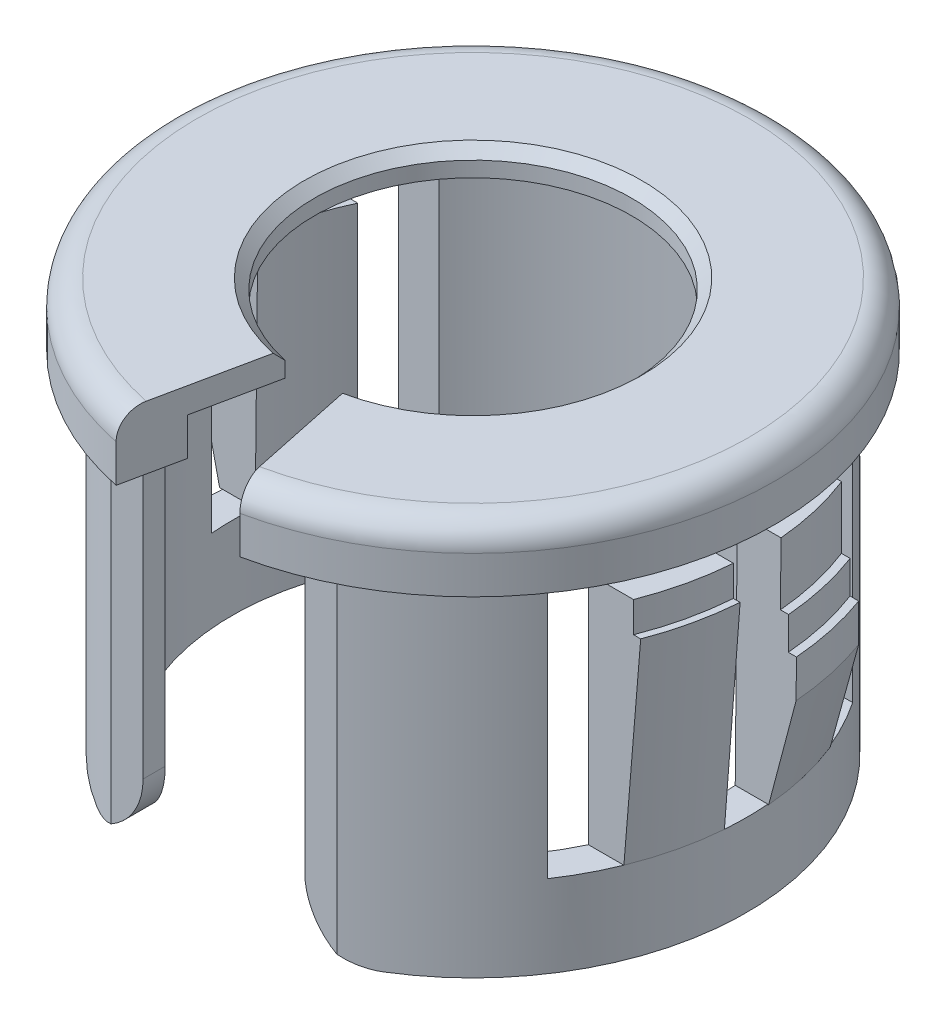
ISO-10303-21;
HEADER;
FILE_DESCRIPTION(('STEP AP214'),'2;1');
FILE_NAME('part.step','',(''),(''),'','','');
FILE_SCHEMA(('AUTOMOTIVE_DESIGN { 1 0 10303 214 1 1 1 1 }'));
ENDSEC;
DATA;
#1=APPLICATION_CONTEXT('core data for automotive mechanical design processes');
#2=APPLICATION_PROTOCOL_DEFINITION('international standard','automotive_design',2000,#1);
#3=PRODUCT_CONTEXT('',#1,'mechanical');
#4=PRODUCT('Part','Part','',(#3));
#5=PRODUCT_RELATED_PRODUCT_CATEGORY('part','',(#4));
#6=PRODUCT_DEFINITION_FORMATION('','',#4);
#7=PRODUCT_DEFINITION_CONTEXT('part definition',#1,'design');
#8=PRODUCT_DEFINITION('design','',#6,#7);
#9=PRODUCT_DEFINITION_SHAPE('','',#8);
#10=(LENGTH_UNIT() NAMED_UNIT(*) SI_UNIT(.MILLI.,.METRE.));
#11=(NAMED_UNIT(*) PLANE_ANGLE_UNIT() SI_UNIT($,.RADIAN.));
#12=(NAMED_UNIT(*) SI_UNIT($,.STERADIAN.) SOLID_ANGLE_UNIT());
#13=UNCERTAINTY_MEASURE_WITH_UNIT(LENGTH_MEASURE(1.E-05),#10,'distance_accuracy_value','');
#14=(GEOMETRIC_REPRESENTATION_CONTEXT(3) GLOBAL_UNCERTAINTY_ASSIGNED_CONTEXT((#13)) GLOBAL_UNIT_ASSIGNED_CONTEXT((#10,
#11,#12)) REPRESENTATION_CONTEXT('',''));
#15=CARTESIAN_POINT('',(0.,0.,0.));
#16=DIRECTION('',(0.,0.,1.));
#17=DIRECTION('',(1.,0.,0.));
#18=AXIS2_PLACEMENT_3D('',#15,#16,#17);
#19=CARTESIAN_POINT('',(0.,7.92480000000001,0.));
#20=DIRECTION('',(0.,-1.,0.));
#21=DIRECTION('',(0.,0.,-1.));
#22=AXIS2_PLACEMENT_3D('',#19,#20,#21);
#23=CYLINDRICAL_SURFACE('',#22,7.30928858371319);
#24=CARTESIAN_POINT('',(7.2849396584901,6.37540000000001,-0.59611556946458));
#25=CARTESIAN_POINT('',(7.28496690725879,6.34153333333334,-0.595782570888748));
#26=CARTESIAN_POINT('',(7.28499413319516,6.30766666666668,-0.595449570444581));
#27=CARTESIAN_POINT('',(7.28504853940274,6.23993333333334,-0.594783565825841));
#28=CARTESIAN_POINT('',(7.28507571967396,6.20606666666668,-0.594450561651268));
#29=CARTESIAN_POINT('',(7.28513003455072,6.13833333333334,-0.593784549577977));
#30=CARTESIAN_POINT('',(7.28515716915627,6.10446666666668,-0.593451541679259));
#31=CARTESIAN_POINT('',(7.2852113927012,6.03673333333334,-0.592785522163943));
#32=CARTESIAN_POINT('',(7.28523848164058,6.00286666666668,-0.592452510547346));
#33=CARTESIAN_POINT('',(7.28529261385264,5.93513333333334,-0.591786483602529));
#34=CARTESIAN_POINT('',(7.28531965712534,5.90126666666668,-0.59145346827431));
#35=CARTESIAN_POINT('',(7.28537369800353,5.83353333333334,-0.590787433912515));
#36=CARTESIAN_POINT('',(7.28540069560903,5.79966666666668,-0.590454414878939));
#37=CARTESIAN_POINT('',(7.28545464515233,5.73193333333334,-0.589788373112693));
#38=CARTESIAN_POINT('',(7.28548159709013,5.69806666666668,-0.589455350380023));
#39=CARTESIAN_POINT('',(7.28553545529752,5.63033333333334,-0.58878930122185));
#40=CARTESIAN_POINT('',(7.28556236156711,5.59646666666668,-0.588456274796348));
#41=CARTESIAN_POINT('',(7.28558924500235,5.56260000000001,-0.588123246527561));
#42=B_SPLINE_CURVE_WITH_KNOTS('',3,(#24,#25,#26,#27,#28,#29,#30,#31,#32,#33,#34,#35,#36,#37,#38,
#39,#40,#41),.UNSPECIFIED.,.F.,.F.,(4,2,2,2,2,2,2,2,4),(0.,0.101604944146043,0.203209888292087,
0.304814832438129,0.406419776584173,0.508024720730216,0.609629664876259,0.711234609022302,
0.812839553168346),.UNSPECIFIED.);
#43=CARTESIAN_POINT('',(7.2849396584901,6.37539999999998,-0.596115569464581));
#44=VERTEX_POINT('',#43);
#45=CARTESIAN_POINT('',(7.28558924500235,5.56260000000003,-0.588123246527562));
#46=VERTEX_POINT('',#45);
#47=EDGE_CURVE('E341',#44,#46,#42,.T.);
#48=ORIENTED_EDGE('',*,*,#47,.T.);
#49=CARTESIAN_POINT('',(0.,5.56260000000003,0.));
#50=DIRECTION('',(0.,-1.,0.));
#51=DIRECTION('',(0.,0.,-1.));
#52=AXIS2_PLACEMENT_3D('',#49,#50,#51);
#53=CIRCLE('',#52,7.30928858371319);
#54=CARTESIAN_POINT('',(6.84033487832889,5.56259999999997,-2.57594999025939));
#55=VERTEX_POINT('',#54);
#56=EDGE_CURVE('E345',#55,#46,#53,.T.);
#57=ORIENTED_EDGE('',*,*,#56,.F.);
#58=CARTESIAN_POINT('',(6.84033487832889,5.5626,-2.57594999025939));
#59=CARTESIAN_POINT('',(6.84029649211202,5.59646666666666,-2.57605192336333));
#60=CARTESIAN_POINT('',(6.84025810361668,5.63033333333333,-2.57615385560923));
#61=CARTESIAN_POINT('',(6.84018132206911,5.69806666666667,-2.57635771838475));
#62=CARTESIAN_POINT('',(6.8401429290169,5.73193333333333,-2.57645964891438));
#63=CARTESIAN_POINT('',(6.84006613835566,5.79966666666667,-2.57666350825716));
#64=CARTESIAN_POINT('',(6.84002774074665,5.83353333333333,-2.57676543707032));
#65=CARTESIAN_POINT('',(6.83995094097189,5.90126666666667,-2.57696929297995));
#66=CARTESIAN_POINT('',(6.83991253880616,5.93513333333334,-2.57707122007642));
#67=CARTESIAN_POINT('',(6.83983572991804,6.00286666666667,-2.57727507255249));
#68=CARTESIAN_POINT('',(6.83979732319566,6.03673333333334,-2.57737699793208));
#69=CARTESIAN_POINT('',(6.83972050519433,6.10446666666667,-2.57758084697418));
#70=CARTESIAN_POINT('',(6.83968209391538,6.13833333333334,-2.57768277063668));
#71=CARTESIAN_POINT('',(6.83960526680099,6.20606666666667,-2.5778866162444));
#72=CARTESIAN_POINT('',(6.83956685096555,6.23993333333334,-2.57798853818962));
#73=CARTESIAN_POINT('',(6.83949001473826,6.30766666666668,-2.57819238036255));
#74=CARTESIAN_POINT('',(6.8394515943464,6.34153333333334,-2.57829430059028));
#75=CARTESIAN_POINT('',(6.83941317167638,6.37540000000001,-2.57839621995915));
#76=B_SPLINE_CURVE_WITH_KNOTS('',3,(#58,#59,#60,#61,#62,#63,#64,#65,#66,#67,#68,#69,#70,#71,#72,
#73,#74,#75),.UNSPECIFIED.,.F.,.F.,(4,2,2,2,2,2,2,2,4),(0.,0.101600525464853,0.203201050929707,
0.304801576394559,0.406402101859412,0.508002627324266,0.609603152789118,0.711203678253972,
0.812804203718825),.UNSPECIFIED.);
#77=CARTESIAN_POINT('',(6.83941317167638,6.37539999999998,-2.57839621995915));
#78=VERTEX_POINT('',#77);
#79=EDGE_CURVE('E328',#55,#78,#76,.T.);
#80=ORIENTED_EDGE('',*,*,#79,.T.);
#81=CARTESIAN_POINT('',(0.,6.37539999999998,0.));
#82=DIRECTION('',(0.,-1.,0.));
#83=DIRECTION('',(0.,0.,-1.));
#84=AXIS2_PLACEMENT_3D('',#81,#82,#83);
#85=CIRCLE('',#84,7.30928858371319);
#86=EDGE_CURVE('E359',#44,#78,#85,.F.);
#87=ORIENTED_EDGE('',*,*,#86,.F.);
#88=EDGE_LOOP('',(#48,#57,#80,#87));
#89=FACE_BOUND('',#88,.T.);
#90=ADVANCED_FACE('F18',(#89),#23,.T.);
#91=CARTESIAN_POINT('',(6.98215549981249,5.56260000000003,-2.7711133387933));
#92=DIRECTION('',(0.,1.,0.));
#93=DIRECTION('',(0.,0.,1.));
#94=AXIS2_PLACEMENT_3D('',#91,#92,#93);
#95=PLANE('',#94);
#96=DIRECTION('',(1.,0.,0.));
#97=VECTOR('',#96,1.);
#98=CARTESIAN_POINT('',(6.98215549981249,5.56260000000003,-0.588123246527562));
#99=LINE('',#98,#97);
#100=CARTESIAN_POINT('',(7.48890349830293,5.56260000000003,-0.588123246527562));
#101=VERTEX_POINT('',#100);
#102=EDGE_CURVE('E349',#46,#101,#99,.T.);
#103=ORIENTED_EDGE('',*,*,#102,.T.);
#104=CARTESIAN_POINT('',(0.,5.56260000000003,0.));
#105=DIRECTION('',(0.,-1.,0.));
#106=DIRECTION('',(0.,0.,-1.));
#107=AXIS2_PLACEMENT_3D('',#104,#105,#106);
#108=CIRCLE('',#107,7.51196143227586);
#109=CARTESIAN_POINT('',(7.05648965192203,5.56260000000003,-2.57594999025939));
#110=VERTEX_POINT('',#109);
#111=EDGE_CURVE('E354',#110,#101,#108,.T.);
#112=ORIENTED_EDGE('',*,*,#111,.F.);
#113=DIRECTION('',(1.,0.,0.));
#114=VECTOR('',#113,1.);
#115=CARTESIAN_POINT('',(-12.7,5.56260000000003,-2.57594999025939));
#116=LINE('',#115,#114);
#117=EDGE_CURVE('E334',#110,#55,#116,.F.);
#118=ORIENTED_EDGE('',*,*,#117,.T.);
#119=ORIENTED_EDGE('',*,*,#56,.T.);
#120=EDGE_LOOP('',(#103,#112,#118,#119));
#121=FACE_BOUND('',#120,.T.);
#122=ADVANCED_FACE('F352',(#121),#95,.T.);
#123=CARTESIAN_POINT('',(6.78844098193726,6.37539999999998,-2.70975434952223));
#124=DIRECTION('',(0.,1.,0.));
#125=DIRECTION('',(0.,0.,1.));
#126=AXIS2_PLACEMENT_3D('',#123,#124,#125);
#127=PLANE('',#126);
#128=DIRECTION('',(1.,0.,0.));
#129=VECTOR('',#128,1.);
#130=CARTESIAN_POINT('',(6.78844098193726,6.37539999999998,-0.596115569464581));
#131=LINE('',#130,#129);
#132=CARTESIAN_POINT('',(7.08160019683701,6.37539999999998,-0.596115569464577));
#133=VERTEX_POINT('',#132);
#134=EDGE_CURVE('E997',#133,#44,#131,.T.);
#135=ORIENTED_EDGE('',*,*,#134,.T.);
#136=ORIENTED_EDGE('',*,*,#86,.T.);
#137=DIRECTION('',(1.,0.,0.));
#138=VECTOR('',#137,1.);
#139=CARTESIAN_POINT('',(-12.7,6.37539999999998,-2.57839621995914));
#140=LINE('',#139,#138);
#141=CARTESIAN_POINT('',(6.62240802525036,6.37539999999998,-2.57839621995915));
#142=VERTEX_POINT('',#141);
#143=EDGE_CURVE('E337',#78,#142,#140,.F.);
#144=ORIENTED_EDGE('',*,*,#143,.T.);
#145=CARTESIAN_POINT('',(0.,6.37539999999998,0.));
#146=DIRECTION('',(0.,-1.,0.));
#147=DIRECTION('',(0.,0.,-1.));
#148=AXIS2_PLACEMENT_3D('',#145,#146,#147);
#149=CIRCLE('',#148,7.1066458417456);
#150=EDGE_CURVE('E996',#133,#142,#149,.F.);
#151=ORIENTED_EDGE('',*,*,#150,.F.);
#152=EDGE_LOOP('',(#135,#136,#144,#151));
#153=FACE_BOUND('',#152,.T.);
#154=ADVANCED_FACE('F1859',(#153),#127,.T.);
#155=CARTESIAN_POINT('',(-12.7,2.05719244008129,-2.5654));
#156=DIRECTION('',(0.,0.00300961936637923,0.999995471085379));
#157=DIRECTION('',(0.,-0.999995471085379,0.00300961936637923));
#158=AXIS2_PLACEMENT_3D('',#155,#156,#157);
#159=PLANE('',#158);
#160=DIRECTION('',(0.00950148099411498,0.999950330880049,-0.00300958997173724));
#161=VECTOR('',#160,1.);
#162=CARTESIAN_POINT('',(6.33270444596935,2.05739999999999,-2.5654));
#163=LINE('',#162,#161);
#164=CARTESIAN_POINT('',(6.33270444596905,2.05719244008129,-2.56540000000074));
#165=VERTEX_POINT('',#164);
#166=CARTESIAN_POINT('',(6.38845620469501,7.92480000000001,-2.58305934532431));
#167=VERTEX_POINT('',#166);
#168=EDGE_CURVE('E1181',#165,#167,#163,.T.);
#169=ORIENTED_EDGE('',*,*,#168,.T.);
#170=DIRECTION('',(1.,0.,0.));
#171=VECTOR('',#170,1.);
#172=CARTESIAN_POINT('',(-12.7,7.92480000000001,-2.58305934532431));
#173=LINE('',#172,#171);
#174=CARTESIAN_POINT('',(6.62059057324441,7.92480000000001,-2.58305934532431));
#175=VERTEX_POINT('',#174);
#176=EDGE_CURVE('E357',#175,#167,#173,.F.);
#177=ORIENTED_EDGE('',*,*,#176,.F.);
#178=CARTESIAN_POINT('',(6.62240802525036,6.37540000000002,-2.57839621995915));
#179=CARTESIAN_POINT('',(6.6223323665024,6.43995833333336,-2.57859054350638));
#180=CARTESIAN_POINT('',(6.6222566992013,6.50451666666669,-2.5787848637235));
#181=CARTESIAN_POINT('',(6.62210534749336,6.63363333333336,-2.57917349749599));
#182=CARTESIAN_POINT('',(6.62202966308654,6.69819166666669,-2.57936781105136));
#183=CARTESIAN_POINT('',(6.62187827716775,6.82730833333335,-2.57975643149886));
#184=CARTESIAN_POINT('',(6.6218025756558,6.89186666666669,-2.57995073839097));
#185=CARTESIAN_POINT('',(6.62165115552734,7.02098333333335,-2.58033934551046));
#186=CARTESIAN_POINT('',(6.62157543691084,7.08554166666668,-2.58053364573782));
#187=CARTESIAN_POINT('',(6.62142398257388,7.21465833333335,-2.58092223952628));
#188=CARTESIAN_POINT('',(6.62134824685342,7.27921666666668,-2.58111653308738));
#189=CARTESIAN_POINT('',(6.62119675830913,7.40833333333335,-2.5815051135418));
#190=CARTESIAN_POINT('',(6.62112100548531,7.47289166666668,-2.58169940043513));
#191=CARTESIAN_POINT('',(6.62096948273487,7.60200833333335,-2.58208796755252));
#192=CARTESIAN_POINT('',(6.62089371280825,7.66656666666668,-2.58228224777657));
#193=CARTESIAN_POINT('',(6.62074215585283,7.79568333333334,-2.5826708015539));
#194=CARTESIAN_POINT('',(6.62066636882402,7.86024166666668,-2.58286507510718));
#195=CARTESIAN_POINT('',(6.62059057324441,7.92480000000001,-2.58305934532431));
#196=B_SPLINE_CURVE_WITH_KNOTS('',3,(#178,#179,#180,#181,#182,#183,#184,#185,#186,#187,#188,
#189,#190,#191,#192,#193,#194,#195),.UNSPECIFIED.,.F.,.F.,(4,2,2,2,2,2,2,2,4),(0.,
0.193676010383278,0.387352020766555,0.581028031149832,0.774704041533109,0.968380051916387,
1.16205606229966,1.35573207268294,1.54940808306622),.UNSPECIFIED.);
#197=EDGE_CURVE('E1164',#142,#175,#196,.T.);
#198=ORIENTED_EDGE('',*,*,#197,.F.);
#199=ORIENTED_EDGE('',*,*,#143,.F.);
#200=ORIENTED_EDGE('',*,*,#79,.F.);
#201=ORIENTED_EDGE('',*,*,#117,.F.);
#202=CARTESIAN_POINT('',(7.0575215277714,4.62280000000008,-2.57312153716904));
#203=CARTESIAN_POINT('',(7.05747855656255,4.66195833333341,-2.57323939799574));
#204=CARTESIAN_POINT('',(7.05743558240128,4.70111666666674,-2.57335725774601));
#205=CARTESIAN_POINT('',(7.057349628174,4.77943333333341,-2.57359297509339));
#206=CARTESIAN_POINT('',(7.05730664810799,4.81859166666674,-2.5737108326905));
#207=CARTESIAN_POINT('',(7.05722068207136,4.8969083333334,-2.57394654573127));
#208=CARTESIAN_POINT('',(7.05717769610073,4.93606666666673,-2.57406440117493));
#209=CARTESIAN_POINT('',(7.05709171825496,5.01438333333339,-2.5743001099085));
#210=CARTESIAN_POINT('',(7.05704872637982,5.05354166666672,-2.57441796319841));
#211=CARTESIAN_POINT('',(7.05696273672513,5.13185833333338,-2.57465366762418));
#212=CARTESIAN_POINT('',(7.05691973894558,5.17101666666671,-2.57477151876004));
#213=CARTESIAN_POINT('',(7.05683373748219,5.24933333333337,-2.57500721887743));
#214=CARTESIAN_POINT('',(7.05679073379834,5.2884916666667,-2.57512506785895));
#215=CARTESIAN_POINT('',(7.05670472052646,5.36680833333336,-2.57536076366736));
#216=CARTESIAN_POINT('',(7.05666171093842,5.40596666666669,-2.57547861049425));
#217=CARTESIAN_POINT('',(7.05657568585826,5.48428333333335,-2.57571430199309));
#218=CARTESIAN_POINT('',(7.05653267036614,5.52344166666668,-2.57583214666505));
#219=CARTESIAN_POINT('',(7.05648965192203,5.56260000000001,-2.57594999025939));
#220=B_SPLINE_CURVE_WITH_KNOTS('',3,(#202,#203,#204,#205,#206,#207,#208,#209,#210,#211,#212,
#213,#214,#215,#216,#217,#218,#219),.UNSPECIFIED.,.F.,.F.,(4,2,2,2,2,2,2,2,4),(0.,
0.117475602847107,0.234951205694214,0.35242680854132,0.469902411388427,0.587378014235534,
0.704853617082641,0.822329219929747,0.939804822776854),.UNSPECIFIED.);
#221=CARTESIAN_POINT('',(7.0575215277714,4.62280000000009,-2.57312153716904));
#222=VERTEX_POINT('',#221);
#223=EDGE_CURVE('E980',#222,#110,#220,.T.);
#224=ORIENTED_EDGE('',*,*,#223,.F.);
#225=CARTESIAN_POINT('',(6.35512847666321,2.05740000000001,-2.56540062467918));
#226=CARTESIAN_POINT('',(6.6900691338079,3.27292762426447,-2.56905891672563));
#227=CARTESIAN_POINT('',(7.0575215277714,4.62280000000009,-2.57312153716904));
#228=B_SPLINE_CURVE_WITH_KNOTS('',2,(#225,#226,#227),.UNSPECIFIED.,.F.,.F.,(3,3),(0.,1.),.UNSPECIFIED.);
#229=CARTESIAN_POINT('',(6.35512847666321,2.05739999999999,-2.56540062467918));
#230=VERTEX_POINT('',#229);
#231=EDGE_CURVE('E987',#230,#222,#228,.T.);
#232=ORIENTED_EDGE('',*,*,#231,.F.);
#233=DIRECTION('',(0.999957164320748,0.0092557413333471,-2.7856384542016E-05));
#234=VECTOR('',#233,1.);
#235=CARTESIAN_POINT('',(6.33270444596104,2.05719244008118,-2.5654));
#236=LINE('',#235,#234);
#237=EDGE_CURVE('E355',#165,#230,#236,.T.);
#238=ORIENTED_EDGE('',*,*,#237,.F.);
#239=EDGE_LOOP('',(#169,#177,#198,#199,#200,#201,#224,#232,#238));
#240=FACE_BOUND('',#239,.T.);
#241=ADVANCED_FACE('F331',(#240),#159,.F.);
#242=CARTESIAN_POINT('',(0.,7.92480000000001,0.));
#243=DIRECTION('',(0.,-1.,0.));
#244=DIRECTION('',(0.,0.,-1.));
#245=AXIS2_PLACEMENT_3D('',#242,#243,#244);
#246=CYLINDRICAL_SURFACE('',#245,7.51196143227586);
#247=CARTESIAN_POINT('',(7.48890349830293,5.56260000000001,-0.58812324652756));
#248=CARTESIAN_POINT('',(7.48893373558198,5.52344166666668,-0.587738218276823));
#249=CARTESIAN_POINT('',(7.48896394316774,5.48428333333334,-0.587353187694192));
#250=CARTESIAN_POINT('',(7.48902429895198,5.40596666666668,-0.586583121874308));
#251=CARTESIAN_POINT('',(7.48905444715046,5.36680833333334,-0.586198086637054));
#252=CARTESIAN_POINT('',(7.48911468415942,5.28849166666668,-0.585428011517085));
#253=CARTESIAN_POINT('',(7.48914477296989,5.24933333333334,-0.58504297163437));
#254=CARTESIAN_POINT('',(7.48920489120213,5.17101666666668,-0.584272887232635));
#255=CARTESIAN_POINT('',(7.48923492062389,5.13185833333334,-0.583887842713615));
#256=CARTESIAN_POINT('',(7.48929492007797,5.05354166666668,-0.583117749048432));
#257=CARTESIAN_POINT('',(7.4893248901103,5.01438333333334,-0.58273269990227));
#258=CARTESIAN_POINT('',(7.48938477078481,4.93606666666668,-0.581962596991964));
#259=CARTESIAN_POINT('',(7.48941468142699,4.89690833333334,-0.58157754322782));
#260=CARTESIAN_POINT('',(7.4894744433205,4.81859166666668,-0.580807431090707));
#261=CARTESIAN_POINT('',(7.48950429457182,4.77943333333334,-0.580422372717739));
#262=CARTESIAN_POINT('',(7.48956393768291,4.70111666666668,-0.579652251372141));
#263=CARTESIAN_POINT('',(7.48959372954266,4.66195833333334,-0.579267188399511));
#264=CARTESIAN_POINT('',(7.48962349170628,4.62280000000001,-0.578882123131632));
#265=B_SPLINE_CURVE_WITH_KNOTS('',3,(#247,#248,#249,#250,#251,#252,#253,#254,#255,#256,#257,
#258,#259,#260,#261,#262,#263,#264),.UNSPECIFIED.,.F.,.F.,(4,2,2,2,2,2,2,2,4),(0.,
0.117480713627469,0.23496142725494,0.352442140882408,0.469922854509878,0.587403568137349,
0.704884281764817,0.822364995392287,0.939845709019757),.UNSPECIFIED.);
#266=CARTESIAN_POINT('',(7.48962349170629,4.62280000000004,-0.578882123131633));
#267=VERTEX_POINT('',#266);
#268=EDGE_CURVE('E983',#101,#267,#265,.T.);
#269=ORIENTED_EDGE('',*,*,#268,.T.);
#270=CARTESIAN_POINT('',(1.88217497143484E-13,4.62279999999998,0.));
#271=DIRECTION('',(0.,-1.,0.));
#272=DIRECTION('',(1.,0.,0.));
#273=AXIS2_PLACEMENT_3D('',#270,#271,#272);
#274=CIRCLE('',#273,7.51196143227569);
#275=EDGE_CURVE('E995',#222,#267,#274,.T.);
#276=ORIENTED_EDGE('',*,*,#275,.F.);
#277=ORIENTED_EDGE('',*,*,#223,.T.);
#278=ORIENTED_EDGE('',*,*,#111,.T.);
#279=EDGE_LOOP('',(#269,#276,#277,#278));
#280=FACE_BOUND('',#279,.T.);
#281=ADVANCED_FACE('F970',(#280),#246,.T.);
#282=CARTESIAN_POINT('',(7.2119194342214,7.16280000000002,0.406645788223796));
#283=DIRECTION('',(0.,1.,0.));
#284=DIRECTION('',(0.,0.,1.));
#285=AXIS2_PLACEMENT_3D('',#282,#283,#284);
#286=PLANE('',#285);
#287=DIRECTION('',(1.,0.,0.));
#288=VECTOR('',#287,1.);
#289=CARTESIAN_POINT('',(7.2119194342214,7.16280000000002,2.5654));
#290=LINE('',#289,#288);
#291=CARTESIAN_POINT('',(6.57319675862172,7.16280000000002,2.5654));
#292=VERTEX_POINT('',#291);
#293=CARTESIAN_POINT('',(6.75247107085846,7.16280000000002,2.5654));
#294=VERTEX_POINT('',#293);
#295=EDGE_CURVE('E1083',#292,#294,#290,.T.);
#296=ORIENTED_EDGE('',*,*,#295,.T.);
#297=CARTESIAN_POINT('',(7.20365373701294,7.16280000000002,0.5334));
#298=CARTESIAN_POINT('',(7.18996739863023,7.16280000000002,0.718449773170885));
#299=CARTESIAN_POINT('',(7.16911924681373,7.16280000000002,0.90297583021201));
#300=CARTESIAN_POINT('',(7.11329218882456,7.16280000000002,1.26987816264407));
#301=CARTESIAN_POINT('',(7.0783132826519,7.16280000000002,1.452254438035));
#302=CARTESIAN_POINT('',(6.9996226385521,7.16280000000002,1.79132667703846));
#303=CARTESIAN_POINT('',(6.95753306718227,7.16280000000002,1.94840114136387));
#304=CARTESIAN_POINT('',(6.86283926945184,7.16280000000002,2.25943433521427));
#305=CARTESIAN_POINT('',(6.81022976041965,7.16280000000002,2.41339145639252));
#306=CARTESIAN_POINT('',(6.75247107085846,7.16280000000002,2.5654));
#307=B_SPLINE_CURVE_WITH_KNOTS('',3,(#297,#298,#299,#300,#301,#302,#303,#304,#305,#306),
.UNSPECIFIED.,.F.,.F.,(4,2,2,2,4),(0.,0.556541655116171,1.11308331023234,1.60056713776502,
2.08829637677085),.UNSPECIFIED.);
#308=CARTESIAN_POINT('',(7.20365373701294,7.16280000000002,0.5334));
#309=VERTEX_POINT('',#308);
#310=EDGE_CURVE('E882',#309,#294,#307,.T.);
#311=ORIENTED_EDGE('',*,*,#310,.F.);
#312=DIRECTION('',(1.,0.,0.));
#313=VECTOR('',#312,1.);
#314=CARTESIAN_POINT('',(7.2119194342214,7.16280000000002,0.5334));
#315=LINE('',#314,#313);
#316=CARTESIAN_POINT('',(7.03588496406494,7.16280000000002,0.5334));
#317=VERTEX_POINT('',#316);
#318=EDGE_CURVE('E986',#309,#317,#315,.F.);
#319=ORIENTED_EDGE('',*,*,#318,.T.);
#320=CARTESIAN_POINT('',(0.,7.16280000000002,0.));
#321=DIRECTION('',(0.,-1.,0.));
#322=DIRECTION('',(0.,0.,-1.));
#323=AXIS2_PLACEMENT_3D('',#320,#321,#322);
#324=CIRCLE('',#323,7.05607488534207);
#325=EDGE_CURVE('E957',#292,#317,#324,.F.);
#326=ORIENTED_EDGE('',*,*,#325,.F.);
#327=EDGE_LOOP('',(#296,#311,#319,#326));
#328=FACE_BOUND('',#327,.T.);
#329=ADVANCED_FACE('F964',(#328),#286,.T.);
#330=CARTESIAN_POINT('',(-6.78844098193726,5.56260000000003,-2.70975434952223));
#331=DIRECTION('',(0.,1.,0.));
#332=DIRECTION('',(0.,0.,1.));
#333=AXIS2_PLACEMENT_3D('',#330,#331,#332);
#334=PLANE('',#333);
#335=DIRECTION('',(1.,0.,0.));
#336=VECTOR('',#335,1.);
#337=CARTESIAN_POINT('',(-6.78844098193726,5.56260000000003,-0.588123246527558));
#338=LINE('',#337,#336);
#339=CARTESIAN_POINT('',(-7.48890349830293,5.56260000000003,-0.588123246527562));
#340=VERTEX_POINT('',#339);
#341=CARTESIAN_POINT('',(-7.28558924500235,5.56260000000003,-0.588123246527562));
#342=VERTEX_POINT('',#341);
#343=EDGE_CURVE('E1074',#340,#342,#338,.T.);
#344=ORIENTED_EDGE('',*,*,#343,.T.);
#345=CARTESIAN_POINT('',(0.,5.56260000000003,0.));
#346=DIRECTION('',(0.,1.,0.));
#347=DIRECTION('',(0.,0.,1.));
#348=AXIS2_PLACEMENT_3D('',#345,#346,#347);
#349=CIRCLE('',#348,7.30928858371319);
#350=CARTESIAN_POINT('',(-6.84033487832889,5.56260000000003,-2.57594999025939));
#351=VERTEX_POINT('',#350);
#352=EDGE_CURVE('E1065',#351,#342,#349,.T.);
#353=ORIENTED_EDGE('',*,*,#352,.F.);
#354=DIRECTION('',(1.,0.,0.));
#355=VECTOR('',#354,1.);
#356=CARTESIAN_POINT('',(-6.78844098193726,5.56260000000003,-2.57594999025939));
#357=LINE('',#356,#355);
#358=CARTESIAN_POINT('',(-7.05648965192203,5.56260000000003,-2.57594999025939));
#359=VERTEX_POINT('',#358);
#360=EDGE_CURVE('E1081',#351,#359,#357,.F.);
#361=ORIENTED_EDGE('',*,*,#360,.T.);
#362=CARTESIAN_POINT('',(0.,5.56260000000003,0.));
#363=DIRECTION('',(0.,1.,0.));
#364=DIRECTION('',(0.,0.,1.));
#365=AXIS2_PLACEMENT_3D('',#362,#363,#364);
#366=CIRCLE('',#365,7.51196143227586);
#367=EDGE_CURVE('E845',#340,#359,#366,.F.);
#368=ORIENTED_EDGE('',*,*,#367,.F.);
#369=EDGE_LOOP('',(#344,#353,#361,#368));
#370=FACE_BOUND('',#369,.T.);
#371=ADVANCED_FACE('F969',(#370),#334,.T.);
#372=CARTESIAN_POINT('',(0.,7.92480000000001,0.));
#373=DIRECTION('',(0.,1.,0.));
#374=DIRECTION('',(0.,0.,1.));
#375=AXIS2_PLACEMENT_3D('',#372,#373,#374);
#376=CYLINDRICAL_SURFACE('',#375,7.30928858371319);
#377=CARTESIAN_POINT('',(-7.28558924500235,5.56260000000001,-0.588123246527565));
#378=CARTESIAN_POINT('',(-7.28556236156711,5.59646666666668,-0.588456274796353));
#379=CARTESIAN_POINT('',(-7.28553545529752,5.63033333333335,-0.588789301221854));
#380=CARTESIAN_POINT('',(-7.28548159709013,5.69806666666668,-0.589455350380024));
#381=CARTESIAN_POINT('',(-7.28545464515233,5.73193333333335,-0.589788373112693));
#382=CARTESIAN_POINT('',(-7.28540069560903,5.79966666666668,-0.59045441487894));
#383=CARTESIAN_POINT('',(-7.28537369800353,5.83353333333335,-0.590787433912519));
#384=CARTESIAN_POINT('',(-7.28531965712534,5.90126666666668,-0.591453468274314));
#385=CARTESIAN_POINT('',(-7.28529261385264,5.93513333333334,-0.591786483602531));
#386=CARTESIAN_POINT('',(-7.28523848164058,6.00286666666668,-0.592452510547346));
#387=CARTESIAN_POINT('',(-7.2852113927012,6.03673333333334,-0.592785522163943));
#388=CARTESIAN_POINT('',(-7.28515716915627,6.10446666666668,-0.593451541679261));
#389=CARTESIAN_POINT('',(-7.28513003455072,6.13833333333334,-0.593784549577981));
#390=CARTESIAN_POINT('',(-7.28507571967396,6.20606666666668,-0.594450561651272));
#391=CARTESIAN_POINT('',(-7.28504853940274,6.23993333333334,-0.594783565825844));
#392=CARTESIAN_POINT('',(-7.28499413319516,6.30766666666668,-0.595449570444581));
#393=CARTESIAN_POINT('',(-7.28496690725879,6.34153333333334,-0.595782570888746));
#394=CARTESIAN_POINT('',(-7.2849396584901,6.37540000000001,-0.596115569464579));
#395=B_SPLINE_CURVE_WITH_KNOTS('',3,(#377,#378,#379,#380,#381,#382,#383,#384,#385,#386,#387,
#388,#389,#390,#391,#392,#393,#394),.UNSPECIFIED.,.F.,.F.,(4,2,2,2,2,2,2,2,4),(0.,
0.101604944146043,0.203209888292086,0.304814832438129,0.406419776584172,0.508024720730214,
0.609629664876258,0.711234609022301,0.812839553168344),.UNSPECIFIED.);
#396=CARTESIAN_POINT('',(-7.2849396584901,6.37539999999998,-0.596115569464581));
#397=VERTEX_POINT('',#396);
#398=EDGE_CURVE('E1056',#342,#397,#395,.T.);
#399=ORIENTED_EDGE('',*,*,#398,.T.);
#400=CARTESIAN_POINT('',(0.,6.37539999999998,0.));
#401=DIRECTION('',(0.,1.,0.));
#402=DIRECTION('',(0.,0.,1.));
#403=AXIS2_PLACEMENT_3D('',#400,#401,#402);
#404=CIRCLE('',#403,7.30928858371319);
#405=CARTESIAN_POINT('',(-6.83941317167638,6.37539999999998,-2.57839621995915));
#406=VERTEX_POINT('',#405);
#407=EDGE_CURVE('E944',#406,#397,#404,.T.);
#408=ORIENTED_EDGE('',*,*,#407,.F.);
#409=CARTESIAN_POINT('',(-6.83941317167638,6.37539999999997,-2.57839621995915));
#410=CARTESIAN_POINT('',(-6.8394515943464,6.34153333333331,-2.57829430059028));
#411=CARTESIAN_POINT('',(-6.83949001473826,6.30766666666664,-2.57819238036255));
#412=CARTESIAN_POINT('',(-6.83956685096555,6.23993333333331,-2.57798853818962));
#413=CARTESIAN_POINT('',(-6.83960526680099,6.20606666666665,-2.5778866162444));
#414=CARTESIAN_POINT('',(-6.83968209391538,6.13833333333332,-2.57768277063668));
#415=CARTESIAN_POINT('',(-6.83972050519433,6.10446666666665,-2.57758084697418));
#416=CARTESIAN_POINT('',(-6.83979732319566,6.03673333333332,-2.57737699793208));
#417=CARTESIAN_POINT('',(-6.83983572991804,6.00286666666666,-2.57727507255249));
#418=CARTESIAN_POINT('',(-6.83991253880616,5.93513333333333,-2.57707122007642));
#419=CARTESIAN_POINT('',(-6.83995094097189,5.90126666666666,-2.57696929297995));
#420=CARTESIAN_POINT('',(-6.84002774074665,5.83353333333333,-2.57676543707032));
#421=CARTESIAN_POINT('',(-6.84006613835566,5.79966666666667,-2.57666350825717));
#422=CARTESIAN_POINT('',(-6.8401429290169,5.73193333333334,-2.57645964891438));
#423=CARTESIAN_POINT('',(-6.84018132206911,5.69806666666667,-2.57635771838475));
#424=CARTESIAN_POINT('',(-6.84025810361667,5.63033333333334,-2.57615385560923));
#425=CARTESIAN_POINT('',(-6.84029649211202,5.59646666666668,-2.57605192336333));
#426=CARTESIAN_POINT('',(-6.84033487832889,5.56260000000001,-2.57594999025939));
#427=B_SPLINE_CURVE_WITH_KNOTS('',3,(#409,#410,#411,#412,#413,#414,#415,#416,#417,#418,#419,
#420,#421,#422,#423,#424,#425,#426),.UNSPECIFIED.,.F.,.F.,(4,2,2,2,2,2,2,2,4),(0.,
0.101600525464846,0.203201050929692,0.304801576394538,0.406402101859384,0.50800262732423,
0.609603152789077,0.711203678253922,0.812804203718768),.UNSPECIFIED.);
#428=EDGE_CURVE('E1066',#406,#351,#427,.T.);
#429=ORIENTED_EDGE('',*,*,#428,.T.);
#430=ORIENTED_EDGE('',*,*,#352,.T.);
#431=EDGE_LOOP('',(#399,#408,#429,#430));
#432=FACE_BOUND('',#431,.T.);
#433=ADVANCED_FACE('F1049',(#432),#376,.T.);
#434=CARTESIAN_POINT('',(3.9624,10.3124,0.));
#435=DIRECTION('',(0.,1.,0.));
#436=DIRECTION('',(0.,0.,1.));
#437=AXIS2_PLACEMENT_3D('',#434,#435,#436);
#438=PLANE('',#437);
#439=CARTESIAN_POINT('',(0.,10.3124,0.));
#440=DIRECTION('',(0.,-1.,0.));
#441=DIRECTION('',(0.,0.,-1.));
#442=AXIS2_PLACEMENT_3D('',#439,#440,#441);
#443=CIRCLE('',#442,6.8961);
#444=CARTESIAN_POINT('',(0.,10.3124,-6.8961));
#445=VERTEX_POINT('',#444);
#446=CARTESIAN_POINT('',(1.41545566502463,10.3124,6.74927258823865));
#447=VERTEX_POINT('',#446);
#448=EDGE_CURVE('E1022',#445,#447,#443,.T.);
#449=ORIENTED_EDGE('',*,*,#448,.F.);
#450=CARTESIAN_POINT('',(0.,10.3124,0.));
#451=DIRECTION('',(0.,-1.,0.));
#452=DIRECTION('',(-0.205254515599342,0.,0.978708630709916));
#453=AXIS2_PLACEMENT_3D('',#450,#451,#452);
#454=CIRCLE('',#453,6.8961);
#455=CARTESIAN_POINT('',(-1.41545566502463,10.3124,6.74927258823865));
#456=VERTEX_POINT('',#455);
#457=EDGE_CURVE('E1019',#456,#445,#454,.T.);
#458=ORIENTED_EDGE('',*,*,#457,.F.);
#459=DIRECTION('',(-0.205254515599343,0.,0.978708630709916));
#460=VECTOR('',#459,1.);
#461=CARTESIAN_POINT('',(0.,10.3124,0.));
#462=LINE('',#461,#460);
#463=CARTESIAN_POINT('',(-0.865435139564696,10.3123999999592,4.12662707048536));
#464=VERTEX_POINT('',#463);
#465=EDGE_CURVE('E793',#456,#464,#462,.F.);
#466=ORIENTED_EDGE('',*,*,#465,.T.);
#467=CARTESIAN_POINT('',(0.,10.3123999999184,0.));
#468=DIRECTION('',(0.,1.,0.));
#469=DIRECTION('',(0.,0.,1.));
#470=AXIS2_PLACEMENT_3D('',#467,#468,#469);
#471=CIRCLE('',#470,4.2163999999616);
#472=CARTESIAN_POINT('',(0.865435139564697,10.3123999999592,4.12662707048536));
#473=VERTEX_POINT('',#472);
#474=EDGE_CURVE('E1064',#464,#473,#471,.F.);
#475=ORIENTED_EDGE('',*,*,#474,.T.);
#476=DIRECTION('',(-0.205254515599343,0.,-0.978708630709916));
#477=VECTOR('',#476,1.);
#478=CARTESIAN_POINT('',(0.,10.3124,0.));
#479=LINE('',#478,#477);
#480=EDGE_CURVE('E781',#473,#447,#479,.F.);
#481=ORIENTED_EDGE('',*,*,#480,.T.);
#482=EDGE_LOOP('',(#449,#458,#466,#475,#481));
#483=FACE_BOUND('',#482,.T.);
#484=ADVANCED_FACE('F1030',(#483),#438,.T.);
#485=CARTESIAN_POINT('',(0.,10.3123999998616,0.));
#486=DIRECTION('',(0.,1.,0.));
#487=DIRECTION('',(0.,0.,1.));
#488=AXIS2_PLACEMENT_3D('',#485,#486,#487);
#489=CONICAL_SURFACE('',#488,4.21639999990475,0.785398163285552);
#490=CARTESIAN_POINT('',(0.,10.0584,0.));
#491=DIRECTION('',(0.,-1.,0.));
#492=DIRECTION('',(0.,0.,-1.));
#493=AXIS2_PLACEMENT_3D('',#490,#491,#492);
#494=CIRCLE('',#493,3.9624);
#495=CARTESIAN_POINT('',(-0.813300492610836,10.0584,3.87803507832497));
#496=VERTEX_POINT('',#495);
#497=CARTESIAN_POINT('',(0.813300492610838,10.0584,3.87803507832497));
#498=VERTEX_POINT('',#497);
#499=EDGE_CURVE('E775',#496,#498,#494,.T.);
#500=ORIENTED_EDGE('',*,*,#499,.T.);
#501=DIRECTION('',(0.145136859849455,0.707106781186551,0.692051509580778));
#502=VECTOR('',#501,1.);
#503=CARTESIAN_POINT('',(0.813300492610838,10.0584,3.87803507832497));
#504=LINE('',#503,#502);
#505=EDGE_CURVE('E786',#498,#473,#504,.T.);
#506=ORIENTED_EDGE('',*,*,#505,.T.);
#507=ORIENTED_EDGE('',*,*,#474,.F.);
#508=DIRECTION('',(0.145136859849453,-0.707106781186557,-0.692051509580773));
#509=VECTOR('',#508,1.);
#510=CARTESIAN_POINT('',(-0.865435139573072,10.3124,4.1266270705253));
#511=LINE('',#510,#509);
#512=EDGE_CURVE('E796',#464,#496,#511,.T.);
#513=ORIENTED_EDGE('',*,*,#512,.T.);
#514=EDGE_LOOP('',(#500,#506,#507,#513));
#515=FACE_BOUND('',#514,.T.);
#516=ADVANCED_FACE('F1048',(#515),#489,.F.);
#517=CARTESIAN_POINT('',(6.59472646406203,7.92480000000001,-2.64839536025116));
#518=DIRECTION('',(0.301963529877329,0.,0.953319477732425));
#519=DIRECTION('',(0.953319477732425,0.,-0.301963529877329));
#520=AXIS2_PLACEMENT_3D('',#517,#518,#519);
#521=PLANE('',#520);
#522=ORIENTED_EDGE('',*,*,#168,.F.);
#523=DIRECTION('',(0.,1.,0.));
#524=VECTOR('',#523,1.);
#525=CARTESIAN_POINT('',(6.33270444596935,7.92480000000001,-2.5654));
#526=LINE('',#525,#524);
#527=CARTESIAN_POINT('',(6.33270444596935,7.92480000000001,-2.5654));
#528=VERTEX_POINT('',#527);
#529=EDGE_CURVE('E769',#528,#165,#526,.F.);
#530=ORIENTED_EDGE('',*,*,#529,.F.);
#531=DIRECTION('',(0.953319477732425,0.,-0.301963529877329));
#532=VECTOR('',#531,1.);
#533=CARTESIAN_POINT('',(6.59472646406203,7.92480000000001,-2.64839536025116));
#534=LINE('',#533,#532);
#535=EDGE_CURVE('E1179',#167,#528,#534,.F.);
#536=ORIENTED_EDGE('',*,*,#535,.F.);
#537=EDGE_LOOP('',(#522,#530,#536));
#538=FACE_BOUND('',#537,.T.);
#539=ADVANCED_FACE('F1160',(#538),#521,.F.);
#540=CARTESIAN_POINT('',(0.,7.92480000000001,0.));
#541=DIRECTION('',(0.,-1.,0.));
#542=DIRECTION('',(0.,0.,-1.));
#543=AXIS2_PLACEMENT_3D('',#540,#541,#542);
#544=CYLINDRICAL_SURFACE('',#543,7.1066458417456);
#545=CARTESIAN_POINT('',(7.08030120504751,7.92480000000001,-0.611350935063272));
#546=CARTESIAN_POINT('',(7.08035601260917,7.86024166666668,-0.610716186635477));
#547=CARTESIAN_POINT('',(7.08041073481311,7.79568333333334,-0.610081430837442));
#548=CARTESIAN_POINT('',(7.0805200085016,7.66656666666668,-0.608811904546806));
#549=CARTESIAN_POINT('',(7.08057455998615,7.60200833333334,-0.608177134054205));
#550=CARTESIAN_POINT('',(7.0806834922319,7.47289166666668,-0.606907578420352));
#551=CARTESIAN_POINT('',(7.08073787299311,7.40833333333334,-0.606272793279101));
#552=CARTESIAN_POINT('',(7.08084646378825,7.27921666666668,-0.605003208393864));
#553=CARTESIAN_POINT('',(7.08090067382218,7.21465833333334,-0.604368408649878));
#554=CARTESIAN_POINT('',(7.08100892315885,7.08554166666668,-0.60309879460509));
#555=CARTESIAN_POINT('',(7.08106296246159,7.02098333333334,-0.602463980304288));
#556=CARTESIAN_POINT('',(7.08117087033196,6.89186666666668,-0.601194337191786));
#557=CARTESIAN_POINT('',(7.0812247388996,6.82730833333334,-0.600559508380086));
#558=CARTESIAN_POINT('',(7.08133230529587,6.69819166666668,-0.599289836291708));
#559=CARTESIAN_POINT('',(7.0813860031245,6.63363333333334,-0.59865499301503));
#560=CARTESIAN_POINT('',(7.08149322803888,6.50451666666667,-0.597385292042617));
#561=CARTESIAN_POINT('',(7.08154675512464,6.43995833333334,-0.596750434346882));
#562=CARTESIAN_POINT('',(7.08160019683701,6.37540000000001,-0.596115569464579));
#563=B_SPLINE_CURVE_WITH_KNOTS('',3,(#545,#546,#547,#548,#549,#550,#551,#552,#553,#554,#555,
#556,#557,#558,#559,#560,#561,#562),.UNSPECIFIED.,.F.,.F.,(4,2,2,2,2,2,2,2,4),(0.,
0.193684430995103,0.387368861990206,0.581053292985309,0.774737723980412,0.968422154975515,
1.16210658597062,1.35579101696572,1.54947544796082),.UNSPECIFIED.);
#564=CARTESIAN_POINT('',(7.08030120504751,7.92480000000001,-0.611350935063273));
#565=VERTEX_POINT('',#564);
#566=EDGE_CURVE('E1168',#565,#133,#563,.T.);
#567=ORIENTED_EDGE('',*,*,#566,.T.);
#568=ORIENTED_EDGE('',*,*,#150,.T.);
#569=ORIENTED_EDGE('',*,*,#197,.T.);
#570=CARTESIAN_POINT('',(0.,7.92480000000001,0.));
#571=DIRECTION('',(0.,-1.,0.));
#572=DIRECTION('',(0.,0.,-1.));
#573=AXIS2_PLACEMENT_3D('',#570,#571,#572);
#574=CIRCLE('',#573,7.1066458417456);
#575=EDGE_CURVE('E766',#565,#175,#574,.F.);
#576=ORIENTED_EDGE('',*,*,#575,.F.);
#577=EDGE_LOOP('',(#567,#568,#569,#576));
#578=FACE_BOUND('',#577,.T.);
#579=ADVANCED_FACE('F1151',(#578),#544,.T.);
#580=CARTESIAN_POINT('',(6.352583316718,2.05739999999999,-2.57169662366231));
#581=CARTESIAN_POINT('',(6.61558104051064,2.0574,-1.92204186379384));
#582=CARTESIAN_POINT('',(6.77663193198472,2.0574,-1.23992624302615));
#583=CARTESIAN_POINT('',(6.83198302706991,2.05739999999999,-0.541245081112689));
#584=CARTESIAN_POINT('',(6.98215549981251,4.62280000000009,-2.77111333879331));
#585=CARTESIAN_POINT('',(7.2655468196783,4.62280000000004,-2.05707460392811));
#586=CARTESIAN_POINT('',(7.43695394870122,4.62280000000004,-1.30822111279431));
#587=CARTESIAN_POINT('',(7.49238259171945,4.62280000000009,-0.542003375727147));
#588=(BOUNDED_SURFACE() B_SPLINE_SURFACE(1,3,((#580,#581,#582,#583),(#584,#585,#586,#587)),
.UNSPECIFIED.,.F.,.F.,.F.) B_SPLINE_SURFACE_WITH_KNOTS((2,2),(4,4),(0.,1.),(0.,1.),
.UNSPECIFIED.) GEOMETRIC_REPRESENTATION_ITEM() RATIONAL_B_SPLINE_SURFACE(((1.,0.992232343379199,
0.992232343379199,1.),(1.,0.992232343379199,0.992232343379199,1.))) REPRESENTATION_ITEM('') SURFACE());
#589=CARTESIAN_POINT('',(7.4896234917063,4.62280000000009,-0.578882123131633));
#590=CARTESIAN_POINT('',(7.39409471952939,4.25077666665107,-0.575223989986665));
#591=CARTESIAN_POINT('',(7.29857196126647,3.87875178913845,-0.57156584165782));
#592=CARTESIAN_POINT('',(7.1410386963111,3.26517252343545,-0.565532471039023));
#593=CARTESIAN_POINT('',(7.0790242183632,3.02361915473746,-0.563157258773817));
#594=CARTESIAN_POINT('',(6.95500151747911,2.54051081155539,-0.55840681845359));
#595=CARTESIAN_POINT('',(6.89299329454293,2.29895583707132,-0.55603159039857));
#596=CARTESIAN_POINT('',(6.83098843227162,2.05739999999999,-0.553656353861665));
#597=B_SPLINE_CURVE_WITH_KNOTS('',3,(#589,#590,#591,#592,#593,#594,#595,#596),.UNSPECIFIED.,.F.,
.F.,(4,2,2,4),(0.,1.15232998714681,1.90052461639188,2.64871924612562),.UNSPECIFIED.);
#598=CARTESIAN_POINT('',(6.83098843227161,2.05739999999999,-0.553656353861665));
#599=VERTEX_POINT('',#598);
#600=EDGE_CURVE('E765',#267,#599,#597,.T.);
#601=CARTESIAN_POINT('',(0.,2.05739999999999,0.));
#602=DIRECTION('',(0.,-1.,0.));
#603=DIRECTION('',(0.,0.,-1.));
#604=AXIS2_PLACEMENT_3D('',#601,#602,#603);
#605=CIRCLE('',#604,6.85338882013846);
#606=EDGE_CURVE('E956',#230,#599,#605,.T.);
#607=ORIENTED_EDGE('',*,*,#600,.T.);
#608=ORIENTED_EDGE('',*,*,#606,.F.);
#609=ORIENTED_EDGE('',*,*,#231,.T.);
#610=ORIENTED_EDGE('',*,*,#275,.T.);
#611=EDGE_LOOP('',(#607,#608,#609,#610));
#612=FACE_BOUND('',#611,.T.);
#613=ADVANCED_FACE('F1145',(#612),#588,.T.);
#614=CARTESIAN_POINT('',(0.,7.92480000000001,0.));
#615=DIRECTION('',(0.,-1.,0.));
#616=DIRECTION('',(0.,0.,-1.));
#617=AXIS2_PLACEMENT_3D('',#614,#615,#616);
#618=CYLINDRICAL_SURFACE('',#617,7.05607488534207);
#619=DIRECTION('',(0.,-1.,0.));
#620=VECTOR('',#619,1.);
#621=CARTESIAN_POINT('',(6.57319675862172,7.92480000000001,2.5654));
#622=LINE('',#621,#620);
#623=CARTESIAN_POINT('',(6.57319675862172,7.92480000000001,2.5654));
#624=VERTEX_POINT('',#623);
#625=EDGE_CURVE('E1095',#624,#292,#622,.T.);
#626=ORIENTED_EDGE('',*,*,#625,.T.);
#627=ORIENTED_EDGE('',*,*,#325,.T.);
#628=DIRECTION('',(0.,1.,0.));
#629=VECTOR('',#628,1.);
#630=CARTESIAN_POINT('',(7.03588496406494,2.05739999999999,0.5334));
#631=LINE('',#630,#629);
#632=CARTESIAN_POINT('',(7.03588496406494,7.92480000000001,0.5334));
#633=VERTEX_POINT('',#632);
#634=EDGE_CURVE('E761',#633,#317,#631,.F.);
#635=ORIENTED_EDGE('',*,*,#634,.F.);
#636=CARTESIAN_POINT('',(0.,7.92480000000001,0.));
#637=DIRECTION('',(0.,-1.,0.));
#638=DIRECTION('',(0.,0.,-1.));
#639=AXIS2_PLACEMENT_3D('',#636,#637,#638);
#640=CIRCLE('',#639,7.05607488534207);
#641=EDGE_CURVE('E753',#624,#633,#640,.F.);
#642=ORIENTED_EDGE('',*,*,#641,.F.);
#643=EDGE_LOOP('',(#626,#627,#635,#642));
#644=FACE_BOUND('',#643,.T.);
#645=ADVANCED_FACE('F903',(#644),#618,.T.);
#646=CARTESIAN_POINT('',(0.,9.6774,0.));
#647=DIRECTION('',(0.,-1.,0.));
#648=DIRECTION('',(0.,0.,-1.));
#649=AXIS2_PLACEMENT_3D('',#646,#647,#648);
#650=TOROIDAL_SURFACE('',#649,6.8961,0.634999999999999);
#651=CARTESIAN_POINT('',(1.41545566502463,10.3124,6.74927258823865));
#652=CARTESIAN_POINT('',(1.42278818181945,10.3124303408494,6.78423599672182));
#653=CARTESIAN_POINT('',(1.43011883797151,10.309387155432,6.81919053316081));
#654=CARTESIAN_POINT('',(1.44456717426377,10.2973776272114,6.88808407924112));
#655=CARTESIAN_POINT('',(1.45168501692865,10.2884159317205,6.92202386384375));
#656=CARTESIAN_POINT('',(1.46551393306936,10.2647869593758,6.98796384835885));
#657=CARTESIAN_POINT('',(1.47222480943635,10.2501169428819,7.01996310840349));
#658=CARTESIAN_POINT('',(1.48504472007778,10.2155005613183,7.08109188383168));
#659=CARTESIAN_POINT('',(1.49115386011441,10.1955551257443,7.11022190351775));
#660=CARTESIAN_POINT('',(1.50259871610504,10.1509483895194,7.16479404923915));
#661=CARTESIAN_POINT('',(1.50793435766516,10.1262866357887,7.19023582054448));
#662=CARTESIAN_POINT('',(1.51768001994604,10.0729485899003,7.23670575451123));
#663=CARTESIAN_POINT('',(1.52209005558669,10.0442723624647,7.25773398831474));
#664=CARTESIAN_POINT('',(1.52986048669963,9.98371397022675,7.29478548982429));
#665=CARTESIAN_POINT('',(1.53322056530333,9.95183084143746,7.31080724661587));
#666=CARTESIAN_POINT('',(1.53879261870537,9.88577505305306,7.33737629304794));
#667=CARTESIAN_POINT('',(1.54100526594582,9.85160374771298,7.34792678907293));
#668=CARTESIAN_POINT('',(1.54366976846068,9.79391944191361,7.36063185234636));
#669=CARTESIAN_POINT('',(1.54446523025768,9.77076931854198,7.36442482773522));
#670=CARTESIAN_POINT('',(1.54552641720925,9.72421603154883,7.36948485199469));
#671=CARTESIAN_POINT('',(1.54579289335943,9.70081327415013,7.37075548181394));
#672=CARTESIAN_POINT('',(1.54579228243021,9.6774,7.37075256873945));
#673=B_SPLINE_CURVE_WITH_KNOTS('',3,(#651,#652,#653,#654,#655,#656,#657,#658,#659,#660,#661,
#662,#663,#664,#665,#666,#667,#668,#669,#670,#671,#672),.UNSPECIFIED.,.F.,.F.,(4,2,2,2,2,2,2,2,
2,2,4),(0.,0.107029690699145,0.213975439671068,0.320972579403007,0.427950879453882,
0.534939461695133,0.641926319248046,0.748945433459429,0.855901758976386,0.926184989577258,
0.99636836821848),.UNSPECIFIED.);
#674=CARTESIAN_POINT('',(1.54579228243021,9.6774,7.37075256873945));
#675=VERTEX_POINT('',#674);
#676=EDGE_CURVE('E893',#447,#675,#673,.T.);
#677=ORIENTED_EDGE('',*,*,#676,.T.);
#678=CARTESIAN_POINT('',(0.,9.6774,0.));
#679=DIRECTION('',(0.,-1.,0.));
#680=DIRECTION('',(0.,0.,-1.));
#681=AXIS2_PLACEMENT_3D('',#678,#679,#680);
#682=CIRCLE('',#681,7.5311);
#683=CARTESIAN_POINT('',(-1.54579228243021,9.6774,7.37075256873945));
#684=VERTEX_POINT('',#683);
#685=EDGE_CURVE('E720',#684,#675,#682,.T.);
#686=ORIENTED_EDGE('',*,*,#685,.F.);
#687=CARTESIAN_POINT('',(-1.54579228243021,9.6774,7.37075256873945));
#688=CARTESIAN_POINT('',(-1.54579851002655,9.71312402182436,7.37078226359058));
#689=CARTESIAN_POINT('',(-1.54517388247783,9.74883897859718,7.36780387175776));
#690=CARTESIAN_POINT('',(-1.54270887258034,9.81923127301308,7.35605004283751));
#691=CARTESIAN_POINT('',(-1.54086944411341,9.85390940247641,7.34727915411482));
#692=CARTESIAN_POINT('',(-1.53601949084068,9.92128388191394,7.32415327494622));
#693=CARTESIAN_POINT('',(-1.53300840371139,9.95397927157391,7.30979560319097));
#694=CARTESIAN_POINT('',(-1.52590323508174,10.0164378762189,7.27591625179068));
#695=CARTESIAN_POINT('',(-1.52180934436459,10.0462016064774,7.25639548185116));
#696=CARTESIAN_POINT('',(-1.51265361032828,10.1019609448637,7.21273848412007));
#697=CARTESIAN_POINT('',(-1.50759167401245,10.1279561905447,7.18860181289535));
#698=CARTESIAN_POINT('',(-1.49664379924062,10.1754370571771,7.13639940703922));
#699=CARTESIAN_POINT('',(-1.49075787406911,10.1969227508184,7.10833373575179));
#700=CARTESIAN_POINT('',(-1.47832799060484,10.2347802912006,7.04906471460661));
#701=CARTESIAN_POINT('',(-1.4717838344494,10.2511505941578,7.01786042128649));
#702=CARTESIAN_POINT('',(-1.45822558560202,10.2782976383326,6.95321105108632));
#703=CARTESIAN_POINT('',(-1.45121177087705,10.2890776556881,6.91976729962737));
#704=CARTESIAN_POINT('',(-1.43937180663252,10.3020591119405,6.86331117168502));
#705=CARTESIAN_POINT('',(-1.43462013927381,10.3059346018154,6.8406539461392));
#706=CARTESIAN_POINT('',(-1.42506486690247,10.3111047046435,6.79509184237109));
#707=CARTESIAN_POINT('',(-1.42026134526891,10.3124029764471,6.77218736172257));
#708=CARTESIAN_POINT('',(-1.41545566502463,10.3124,6.74927258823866));
#709=B_SPLINE_CURVE_WITH_KNOTS('',3,(#687,#688,#689,#690,#691,#692,#693,#694,#695,#696,#697,
#698,#699,#700,#701,#702,#703,#704,#705,#706,#707,#708),.UNSPECIFIED.,.F.,.F.,(4,2,2,2,2,2,2,2,
2,2,4),(0.,0.107029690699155,0.213975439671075,0.32097257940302,0.427950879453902,
0.534939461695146,0.64192631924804,0.748945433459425,0.855901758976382,0.926184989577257,
0.996368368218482),.UNSPECIFIED.);
#710=EDGE_CURVE('E797',#684,#456,#709,.T.);
#711=ORIENTED_EDGE('',*,*,#710,.T.);
#712=ORIENTED_EDGE('',*,*,#457,.T.);
#713=ORIENTED_EDGE('',*,*,#448,.T.);
#714=EDGE_LOOP('',(#677,#686,#711,#712,#713));
#715=FACE_BOUND('',#714,.T.);
#716=ADVANCED_FACE('F897',(#715),#650,.T.);
#717=CARTESIAN_POINT('',(6.33270444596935,2.05719244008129,-2.5654));
#718=CARTESIAN_POINT('',(6.59605173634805,2.05719244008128,-1.91532572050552));
#719=CARTESIAN_POINT('',(6.75699235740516,2.05719244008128,-1.23264975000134));
#720=CARTESIAN_POINT('',(6.81174773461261,2.05719244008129,-0.533400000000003));
#721=CARTESIAN_POINT('',(6.352583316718,2.05739999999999,-2.57169662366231));
#722=CARTESIAN_POINT('',(6.61657697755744,2.05739999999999,-1.91958170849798));
#723=CARTESIAN_POINT('',(6.77784462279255,2.05739999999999,-1.23479030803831));
#724=CARTESIAN_POINT('',(6.8326,2.05739999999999,-0.533400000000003));
#725=(BOUNDED_SURFACE() B_SPLINE_SURFACE(1,3,((#717,#718,#719,#720),(#721,#722,#723,#724)),
.UNSPECIFIED.,.F.,.F.,.F.) B_SPLINE_SURFACE_WITH_KNOTS((2,2),(4,4),(0.,1.),(0.,1.),
.UNSPECIFIED.) GEOMETRIC_REPRESENTATION_ITEM() RATIONAL_B_SPLINE_SURFACE(((1.,0.992173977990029,
0.992173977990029,1.),(1.,0.992173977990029,0.992173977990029,1.))) REPRESENTATION_ITEM('') SURFACE());
#726=CARTESIAN_POINT('',(6.8326,2.05739999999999,-0.533400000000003));
#727=CARTESIAN_POINT('',(6.81174773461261,2.05719244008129,-0.533400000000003));
#728=(BOUNDED_CURVE() B_SPLINE_CURVE(1,(#726,#727),.UNSPECIFIED.,.F.,
.F.) B_SPLINE_CURVE_WITH_KNOTS((2,2),(0.,1.),
.UNSPECIFIED.) CURVE() GEOMETRIC_REPRESENTATION_ITEM() RATIONAL_B_SPLINE_CURVE((1.,1.)) REPRESENTATION_ITEM(''));
#729=CARTESIAN_POINT('',(6.81174773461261,2.05729622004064,-0.5334));
#730=VERTEX_POINT('',#729);
#731=CARTESIAN_POINT('',(6.8326,2.05739999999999,-0.5334));
#732=VERTEX_POINT('',#731);
#733=EDGE_CURVE('E1111',#730,#732,#728,.F.);
#734=CARTESIAN_POINT('',(0.,2.05719244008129,0.));
#735=DIRECTION('',(0.,-1.,0.));
#736=DIRECTION('',(0.,0.,-1.));
#737=AXIS2_PLACEMENT_3D('',#734,#735,#736);
#738=CIRCLE('',#737,6.8326);
#739=EDGE_CURVE('E702',#165,#730,#738,.T.);
#740=DIRECTION('',(0.0793080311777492,0.,0.996850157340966));
#741=VECTOR('',#740,1.);
#742=CARTESIAN_POINT('',(6.83098843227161,2.05739999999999,-0.553656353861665));
#743=LINE('',#742,#741);
#744=EDGE_CURVE('E762',#732,#599,#743,.F.);
#745=ORIENTED_EDGE('',*,*,#733,.F.);
#746=ORIENTED_EDGE('',*,*,#739,.F.);
#747=ORIENTED_EDGE('',*,*,#237,.T.);
#748=ORIENTED_EDGE('',*,*,#606,.T.);
#749=ORIENTED_EDGE('',*,*,#744,.F.);
#750=EDGE_LOOP('',(#745,#746,#747,#748,#749));
#751=FACE_BOUND('',#750,.T.);
#752=ADVANCED_FACE('F902',(#751),#725,.T.);
#753=CARTESIAN_POINT('',(6.81174773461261,2.05739999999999,0.533400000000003));
#754=CARTESIAN_POINT('',(6.75699235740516,2.05739999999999,1.23264975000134));
#755=CARTESIAN_POINT('',(6.59605173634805,2.05739999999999,1.91532572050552));
#756=CARTESIAN_POINT('',(6.33270444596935,2.05739999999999,2.5654));
#757=CARTESIAN_POINT('',(7.2119194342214,7.16280000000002,0.406645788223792));
#758=CARTESIAN_POINT('',(7.17017582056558,7.16279999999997,1.14697456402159));
#759=CARTESIAN_POINT('',(7.01581836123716,7.16279999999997,1.87223520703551));
#760=CARTESIAN_POINT('',(6.75247107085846,7.16280000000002,2.5654));
#761=(BOUNDED_SURFACE() B_SPLINE_SURFACE(1,3,((#753,#754,#755,#756),(#757,#758,#759,#760)),
.UNSPECIFIED.,.F.,.F.,.F.) B_SPLINE_SURFACE_WITH_KNOTS((2,2),(4,4),(0.,1.),(0.,1.),
.UNSPECIFIED.) GEOMETRIC_REPRESENTATION_ITEM() RATIONAL_B_SPLINE_SURFACE(((1.,0.992173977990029,
0.992173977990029,1.),(1.,0.992173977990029,0.992173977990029,1.))) REPRESENTATION_ITEM('') SURFACE());
#762=DIRECTION('',(0.0819436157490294,0.99663696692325,0.));
#763=VECTOR('',#762,1.);
#764=CARTESIAN_POINT('',(6.33270444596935,2.05739999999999,2.5654));
#765=LINE('',#764,#763);
#766=CARTESIAN_POINT('',(6.33270444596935,2.05739999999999,2.5654));
#767=VERTEX_POINT('',#766);
#768=EDGE_CURVE('E750',#767,#294,#765,.T.);
#769=CARTESIAN_POINT('',(0.,2.05739999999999,0.));
#770=DIRECTION('',(0.,-1.,0.));
#771=DIRECTION('',(0.,0.,-1.));
#772=AXIS2_PLACEMENT_3D('',#769,#770,#771);
#773=CIRCLE('',#772,6.8326);
#774=CARTESIAN_POINT('',(6.81174773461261,2.05739999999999,0.533400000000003));
#775=VERTEX_POINT('',#774);
#776=EDGE_CURVE('E885',#775,#767,#773,.T.);
#777=CARTESIAN_POINT('',(7.20365373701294,7.16280000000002,0.5334));
#778=CARTESIAN_POINT('',(7.14667480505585,6.42348772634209,0.533400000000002));
#779=CARTESIAN_POINT('',(7.08978824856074,5.68416833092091,0.533400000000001));
#780=CARTESIAN_POINT('',(6.99603856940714,4.46360776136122,0.533399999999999));
#781=CARTESIAN_POINT('',(6.95911792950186,3.98237100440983,0.533399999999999));
#782=CARTESIAN_POINT('',(6.88536531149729,3.01989068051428,0.533400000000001));
#783=CARTESIAN_POINT('',(6.84853333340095,2.53864711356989,0.533400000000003));
#784=CARTESIAN_POINT('',(6.81174773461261,2.05739999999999,0.533400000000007));
#785=B_SPLINE_CURVE_WITH_KNOTS('',3,(#777,#778,#779,#780,#781,#782,#783,#784),.UNSPECIFIED.,.F.,
.F.,(4,2,2,4),(0.,2.22451412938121,3.67246700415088,5.12041992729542),.UNSPECIFIED.);
#786=EDGE_CURVE('E758',#309,#775,#785,.T.);
#787=ORIENTED_EDGE('',*,*,#768,.F.);
#788=ORIENTED_EDGE('',*,*,#776,.F.);
#789=ORIENTED_EDGE('',*,*,#786,.F.);
#790=ORIENTED_EDGE('',*,*,#310,.T.);
#791=EDGE_LOOP('',(#787,#788,#789,#790));
#792=FACE_BOUND('',#791,.T.);
#793=ADVANCED_FACE('F959',(#792),#761,.T.);
#794=CARTESIAN_POINT('',(-4.24166691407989,-1.6002,6.223));
#795=DIRECTION('',(0.,0.,1.));
#796=DIRECTION('',(1.,0.,0.));
#797=AXIS2_PLACEMENT_3D('',#794,#795,#796);
#798=PLANE('',#797);
#799=DIRECTION('',(0.,-1.,0.));
#800=VECTOR('',#799,1.);
#801=CARTESIAN_POINT('',(2.82111569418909,0.,6.223));
#802=LINE('',#801,#800);
#803=CARTESIAN_POINT('',(2.82111569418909,8.73760000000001,6.223));
#804=VERTEX_POINT('',#803);
#805=CARTESIAN_POINT('',(2.82111569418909,0.202761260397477,6.223));
#806=VERTEX_POINT('',#805);
#807=EDGE_CURVE('E464',#804,#806,#802,.T.);
#808=ORIENTED_EDGE('',*,*,#807,.F.);
#809=DIRECTION('',(1.,0.,0.));
#810=VECTOR('',#809,1.);
#811=CARTESIAN_POINT('',(-4.24166691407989,8.73760000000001,6.223));
#812=LINE('',#811,#810);
#813=CARTESIAN_POINT('',(2.0193,8.73760000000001,6.223));
#814=VERTEX_POINT('',#813);
#815=EDGE_CURVE('E859',#804,#814,#812,.F.);
#816=ORIENTED_EDGE('',*,*,#815,.T.);
#817=DIRECTION('',(0.,1.,0.));
#818=VECTOR('',#817,1.);
#819=CARTESIAN_POINT('',(2.0193,-1.6002,6.223));
#820=LINE('',#819,#818);
#821=CARTESIAN_POINT('',(2.0193,1.57479999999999,6.223));
#822=VERTEX_POINT('',#821);
#823=EDGE_CURVE('E732',#822,#814,#820,.T.);
#824=ORIENTED_EDGE('',*,*,#823,.F.);
#825=CARTESIAN_POINT('',(3.5941,1.57479999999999,6.223));
#826=DIRECTION('',(0.,0.,-1.));
#827=DIRECTION('',(-1.,0.,0.));
#828=AXIS2_PLACEMENT_3D('',#825,#826,#827);
#829=CIRCLE('',#828,1.5748);
#830=EDGE_CURVE('E729',#806,#822,#829,.T.);
#831=ORIENTED_EDGE('',*,*,#830,.F.);
#832=EDGE_LOOP('',(#808,#816,#824,#831));
#833=FACE_BOUND('',#832,.T.);
#834=ADVANCED_FACE('F1427',(#833),#798,.T.);
#835=CARTESIAN_POINT('',(-6.98215549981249,7.16280000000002,2.7711133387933));
#836=DIRECTION('',(0.,-1.,0.));
#837=DIRECTION('',(0.,0.,-1.));
#838=AXIS2_PLACEMENT_3D('',#835,#836,#837);
#839=PLANE('',#838);
#840=DIRECTION('',(1.,0.,0.));
#841=VECTOR('',#840,1.);
#842=CARTESIAN_POINT('',(-6.98215549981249,7.16280000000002,2.5654));
#843=LINE('',#842,#841);
#844=CARTESIAN_POINT('',(-6.7901663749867,7.16280000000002,2.5654));
#845=VERTEX_POINT('',#844);
#846=CARTESIAN_POINT('',(-7.06033196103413,7.16280000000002,2.5654));
#847=VERTEX_POINT('',#846);
#848=EDGE_CURVE('E855',#845,#847,#843,.F.);
#849=ORIENTED_EDGE('',*,*,#848,.F.);
#850=CARTESIAN_POINT('',(0.,7.16280000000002,0.));
#851=DIRECTION('',(0.,-1.,0.));
#852=DIRECTION('',(0.,0.,-1.));
#853=AXIS2_PLACEMENT_3D('',#850,#851,#852);
#854=CIRCLE('',#853,7.25862497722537);
#855=CARTESIAN_POINT('',(-7.239,7.16280000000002,0.533400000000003));
#856=VERTEX_POINT('',#855);
#857=EDGE_CURVE('E1317',#856,#845,#854,.F.);
#858=ORIENTED_EDGE('',*,*,#857,.F.);
#859=DIRECTION('',(1.,0.,0.));
#860=VECTOR('',#859,1.);
#861=CARTESIAN_POINT('',(-6.98215549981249,7.16280000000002,0.5334));
#862=LINE('',#861,#860);
#863=CARTESIAN_POINT('',(-7.493,7.16280000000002,0.5334));
#864=VERTEX_POINT('',#863);
#865=EDGE_CURVE('E857',#864,#856,#862,.T.);
#866=ORIENTED_EDGE('',*,*,#865,.F.);
#867=CARTESIAN_POINT('',(0.,7.16280000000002,0.));
#868=DIRECTION('',(0.,-1.,0.));
#869=DIRECTION('',(0.,0.,-1.));
#870=AXIS2_PLACEMENT_3D('',#867,#868,#869);
#871=CIRCLE('',#870,7.51196143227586);
#872=EDGE_CURVE('E813',#847,#864,#871,.T.);
#873=ORIENTED_EDGE('',*,*,#872,.F.);
#874=EDGE_LOOP('',(#849,#858,#866,#873));
#875=FACE_BOUND('',#874,.T.);
#876=ADVANCED_FACE('F1368',(#875),#839,.F.);
#877=CARTESIAN_POINT('',(-6.33270444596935,2.05739999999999,-2.5654));
#878=DIRECTION('',(0.,-1.,0.));
#879=DIRECTION('',(0.,0.,-1.));
#880=AXIS2_PLACEMENT_3D('',#877,#878,#879);
#881=PLANE('',#880);
#882=DIRECTION('',(1.,0.,0.));
#883=VECTOR('',#882,1.);
#884=CARTESIAN_POINT('',(-6.33270444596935,2.05739999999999,-0.553656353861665));
#885=LINE('',#884,#883);
#886=CARTESIAN_POINT('',(-6.81013123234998,2.05739999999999,-0.553656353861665));
#887=VERTEX_POINT('',#886);
#888=CARTESIAN_POINT('',(-6.88475679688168,2.05739999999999,-0.553656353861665));
#889=VERTEX_POINT('',#888);
#890=EDGE_CURVE('E846',#887,#889,#885,.F.);
#891=ORIENTED_EDGE('',*,*,#890,.T.);
#892=CARTESIAN_POINT('',(-6.41288789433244,2.05739999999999,-2.56540062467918));
#893=CARTESIAN_POINT('',(-6.48391814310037,2.05739999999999,-2.38789948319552));
#894=CARTESIAN_POINT('',(-6.54754409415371,2.05739999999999,-2.2074224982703));
#895=CARTESIAN_POINT('',(-6.65962460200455,2.05739999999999,-1.84181706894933));
#896=CARTESIAN_POINT('',(-6.70807915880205,2.05739999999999,-1.65668862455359));
#897=CARTESIAN_POINT('',(-6.78163981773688,2.05739999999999,-1.31895730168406));
#898=CARTESIAN_POINT('',(-6.80944285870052,2.05739999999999,-1.16693624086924));
#899=CARTESIAN_POINT('',(-6.854812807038,2.05739999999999,-0.861305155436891));
#900=CARTESIAN_POINT('',(-6.87237515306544,2.05739999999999,-0.707694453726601));
#901=CARTESIAN_POINT('',(-6.88475679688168,2.05739999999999,-0.553656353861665));
#902=B_SPLINE_CURVE_WITH_KNOTS('',3,(#892,#893,#894,#895,#896,#897,#898,#899,#900,#901),
.UNSPECIFIED.,.F.,.F.,(4,2,2,2,4),(0.,0.57341874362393,1.14683748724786,1.61012785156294,
2.07362441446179),.UNSPECIFIED.);
#903=CARTESIAN_POINT('',(-6.41288789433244,2.05739999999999,-2.56540062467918));
#904=VERTEX_POINT('',#903);
#905=EDGE_CURVE('E597',#904,#889,#902,.T.);
#906=ORIENTED_EDGE('',*,*,#905,.F.);
#907=DIRECTION('',(1.,0.,0.));
#908=VECTOR('',#907,1.);
#909=CARTESIAN_POINT('',(-12.7,2.05739999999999,-2.56540062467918));
#910=LINE('',#909,#908);
#911=CARTESIAN_POINT('',(-6.33270527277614,2.05729622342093,-2.56540014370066));
#912=VERTEX_POINT('',#911);
#913=EDGE_CURVE('E814',#904,#912,#910,.T.);
#914=ORIENTED_EDGE('',*,*,#913,.T.);
#915=CARTESIAN_POINT('',(0.,2.05739999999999,0.));
#916=DIRECTION('',(0.,-1.,0.));
#917=DIRECTION('',(0.,0.,-1.));
#918=AXIS2_PLACEMENT_3D('',#915,#916,#917);
#919=CIRCLE('',#918,6.8326);
#920=EDGE_CURVE('E1336',#887,#912,#919,.T.);
#921=ORIENTED_EDGE('',*,*,#920,.F.);
#922=EDGE_LOOP('',(#891,#906,#914,#921));
#923=FACE_BOUND('',#922,.T.);
#924=ADVANCED_FACE('F836',(#923),#881,.T.);
#925=CARTESIAN_POINT('',(0.,7.92480000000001,0.));
#926=DIRECTION('',(0.,1.,0.));
#927=DIRECTION('',(0.,0.,1.));
#928=AXIS2_PLACEMENT_3D('',#925,#926,#927);
#929=CYLINDRICAL_SURFACE('',#928,7.51196143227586);
#930=CARTESIAN_POINT('',(-7.48962349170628,4.62280000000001,-0.57888212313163));
#931=CARTESIAN_POINT('',(-7.48959372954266,4.66195833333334,-0.57926718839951));
#932=CARTESIAN_POINT('',(-7.48956393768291,4.70111666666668,-0.579652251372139));
#933=CARTESIAN_POINT('',(-7.48950429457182,4.77943333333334,-0.580422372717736));
#934=CARTESIAN_POINT('',(-7.4894744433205,4.81859166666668,-0.580807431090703));
#935=CARTESIAN_POINT('',(-7.48941468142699,4.89690833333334,-0.581577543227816));
#936=CARTESIAN_POINT('',(-7.48938477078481,4.93606666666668,-0.581962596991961));
#937=CARTESIAN_POINT('',(-7.4893248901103,5.01438333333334,-0.582732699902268));
#938=CARTESIAN_POINT('',(-7.48929492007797,5.05354166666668,-0.583117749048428));
#939=CARTESIAN_POINT('',(-7.48923492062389,5.13185833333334,-0.583887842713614));
#940=CARTESIAN_POINT('',(-7.48920489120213,5.17101666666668,-0.584272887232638));
#941=CARTESIAN_POINT('',(-7.48914477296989,5.24933333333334,-0.585042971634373));
#942=CARTESIAN_POINT('',(-7.48911468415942,5.28849166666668,-0.585428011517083));
#943=CARTESIAN_POINT('',(-7.48905444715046,5.36680833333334,-0.586198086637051));
#944=CARTESIAN_POINT('',(-7.48902429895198,5.40596666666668,-0.586583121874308));
#945=CARTESIAN_POINT('',(-7.48896394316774,5.48428333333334,-0.587353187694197));
#946=CARTESIAN_POINT('',(-7.48893373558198,5.52344166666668,-0.587738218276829));
#947=CARTESIAN_POINT('',(-7.48890349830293,5.56260000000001,-0.588123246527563));
#948=B_SPLINE_CURVE_WITH_KNOTS('',3,(#930,#931,#932,#933,#934,#935,#936,#937,#938,#939,#940,
#941,#942,#943,#944,#945,#946,#947),.UNSPECIFIED.,.F.,.F.,(4,2,2,2,2,2,2,2,4),(0.,
0.11748071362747,0.23496142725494,0.352442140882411,0.46992285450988,0.58740356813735,
0.70488428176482,0.82236499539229,0.93984570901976),.UNSPECIFIED.);
#949=CARTESIAN_POINT('',(-7.48962349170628,4.62279999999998,-0.578882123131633));
#950=VERTEX_POINT('',#949);
#951=EDGE_CURVE('E841',#950,#340,#948,.T.);
#952=ORIENTED_EDGE('',*,*,#951,.T.);
#953=ORIENTED_EDGE('',*,*,#367,.T.);
#954=DIRECTION('',(-0.00109796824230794,-0.999994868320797,0.00300961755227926));
#955=VECTOR('',#954,1.);
#956=CARTESIAN_POINT('',(-7.05648965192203,5.56259999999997,-2.57594999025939));
#957=LINE('',#956,#955);
#958=CARTESIAN_POINT('',(-7.0575215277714,4.62279999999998,-2.57312153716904));
#959=VERTEX_POINT('',#958);
#960=EDGE_CURVE('E1358',#359,#959,#957,.T.);
#961=ORIENTED_EDGE('',*,*,#960,.T.);
#962=CARTESIAN_POINT('',(0.,4.62279999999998,0.));
#963=DIRECTION('',(0.,-1.,0.));
#964=DIRECTION('',(0.,0.,-1.));
#965=AXIS2_PLACEMENT_3D('',#962,#963,#964);
#966=CIRCLE('',#965,7.5119614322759);
#967=EDGE_CURVE('E569',#950,#959,#966,.T.);
#968=ORIENTED_EDGE('',*,*,#967,.F.);
#969=EDGE_LOOP('',(#952,#953,#961,#968));
#970=FACE_BOUND('',#969,.T.);
#971=ADVANCED_FACE('F832',(#970),#929,.T.);
#972=CARTESIAN_POINT('',(-6.59472646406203,6.37539999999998,-2.64839536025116));
#973=DIRECTION('',(0.,1.,0.));
#974=DIRECTION('',(0.,0.,1.));
#975=AXIS2_PLACEMENT_3D('',#972,#973,#974);
#976=PLANE('',#975);
#977=DIRECTION('',(1.,0.,0.));
#978=VECTOR('',#977,1.);
#979=CARTESIAN_POINT('',(-6.59472646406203,6.37539999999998,-0.596115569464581));
#980=LINE('',#979,#978);
#981=CARTESIAN_POINT('',(-7.08160019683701,6.37539999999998,-0.596115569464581));
#982=VERTEX_POINT('',#981);
#983=EDGE_CURVE('E947',#397,#982,#980,.T.);
#984=ORIENTED_EDGE('',*,*,#983,.T.);
#985=CARTESIAN_POINT('',(0.,6.37539999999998,0.));
#986=DIRECTION('',(0.,1.,0.));
#987=DIRECTION('',(0.,0.,1.));
#988=AXIS2_PLACEMENT_3D('',#985,#986,#987);
#989=CIRCLE('',#988,7.1066458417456);
#990=CARTESIAN_POINT('',(-6.62240802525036,6.37539999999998,-2.57839621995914));
#991=VERTEX_POINT('',#990);
#992=EDGE_CURVE('E556',#991,#982,#989,.T.);
#993=ORIENTED_EDGE('',*,*,#992,.F.);
#994=DIRECTION('',(1.,0.,0.));
#995=VECTOR('',#994,1.);
#996=CARTESIAN_POINT('',(-12.7,6.37539999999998,-2.57839621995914));
#997=LINE('',#996,#995);
#998=EDGE_CURVE('E847',#991,#406,#997,.F.);
#999=ORIENTED_EDGE('',*,*,#998,.T.);
#1000=ORIENTED_EDGE('',*,*,#407,.T.);
#1001=EDGE_LOOP('',(#984,#993,#999,#1000));
#1002=FACE_BOUND('',#1001,.T.);
#1003=ADVANCED_FACE('F827',(#1002),#976,.T.);
#1004=CARTESIAN_POINT('',(-12.7,2.05719244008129,-2.5654));
#1005=DIRECTION('',(0.,0.00300961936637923,0.999995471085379));
#1006=DIRECTION('',(0.,-0.999995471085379,0.00300961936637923));
#1007=AXIS2_PLACEMENT_3D('',#1004,#1005,#1006);
#1008=PLANE('',#1007);
#1009=DIRECTION('',(0.00950114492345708,-0.999950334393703,0.00300948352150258));
#1010=VECTOR('',#1009,1.);
#1011=CARTESIAN_POINT('',(-6.388456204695,7.92480000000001,-2.58305934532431));
#1012=LINE('',#1011,#1010);
#1013=CARTESIAN_POINT('',(-6.388456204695,7.92480000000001,-2.58305934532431));
#1014=VERTEX_POINT('',#1013);
#1015=EDGE_CURVE('E553',#1014,#912,#1012,.T.);
#1016=ORIENTED_EDGE('',*,*,#1015,.T.);
#1017=ORIENTED_EDGE('',*,*,#913,.F.);
#1018=CARTESIAN_POINT('',(-7.0575215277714,4.62280000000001,-2.57312153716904));
#1019=CARTESIAN_POINT('',(-6.7215467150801,3.27871570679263,-2.56907633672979));
#1020=CARTESIAN_POINT('',(-6.41288789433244,2.05740000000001,-2.56540062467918));
#1021=B_SPLINE_CURVE_WITH_KNOTS('',2,(#1018,#1019,#1020),.UNSPECIFIED.,.F.,.F.,(3,3),(0.,1.),.UNSPECIFIED.);
#1022=EDGE_CURVE('E808',#959,#904,#1021,.T.);
#1023=ORIENTED_EDGE('',*,*,#1022,.F.);
#1024=ORIENTED_EDGE('',*,*,#960,.F.);
#1025=ORIENTED_EDGE('',*,*,#360,.F.);
#1026=ORIENTED_EDGE('',*,*,#428,.F.);
#1027=ORIENTED_EDGE('',*,*,#998,.F.);
#1028=CARTESIAN_POINT('',(-6.62059057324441,7.92479999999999,-2.58305934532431));
#1029=CARTESIAN_POINT('',(-6.62066636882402,7.86024166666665,-2.58286507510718));
#1030=CARTESIAN_POINT('',(-6.62074215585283,7.79568333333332,-2.5826708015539));
#1031=CARTESIAN_POINT('',(-6.62089371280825,7.66656666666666,-2.58228224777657));
#1032=CARTESIAN_POINT('',(-6.62096948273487,7.60200833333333,-2.58208796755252));
#1033=CARTESIAN_POINT('',(-6.62112100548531,7.47289166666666,-2.58169940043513));
#1034=CARTESIAN_POINT('',(-6.62119675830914,7.40833333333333,-2.5815051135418));
#1035=CARTESIAN_POINT('',(-6.62134824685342,7.27921666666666,-2.58111653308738));
#1036=CARTESIAN_POINT('',(-6.62142398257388,7.21465833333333,-2.58092223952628));
#1037=CARTESIAN_POINT('',(-6.62157543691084,7.08554166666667,-2.58053364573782));
#1038=CARTESIAN_POINT('',(-6.62165115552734,7.02098333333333,-2.58033934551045));
#1039=CARTESIAN_POINT('',(-6.6218025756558,6.89186666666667,-2.57995073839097));
#1040=CARTESIAN_POINT('',(-6.62187827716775,6.82730833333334,-2.57975643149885));
#1041=CARTESIAN_POINT('',(-6.62202966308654,6.69819166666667,-2.57936781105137));
#1042=CARTESIAN_POINT('',(-6.62210534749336,6.63363333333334,-2.57917349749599));
#1043=CARTESIAN_POINT('',(-6.6222566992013,6.50451666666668,-2.5787848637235));
#1044=CARTESIAN_POINT('',(-6.6223323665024,6.43995833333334,-2.57859054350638));
#1045=CARTESIAN_POINT('',(-6.62240802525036,6.37540000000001,-2.57839621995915));
#1046=B_SPLINE_CURVE_WITH_KNOTS('',3,(#1028,#1029,#1030,#1031,#1032,#1033,#1034,#1035,#1036,
#1037,#1038,#1039,#1040,#1041,#1042,#1043,#1044,#1045),.UNSPECIFIED.,.F.,.F.,(4,2,2,2,2,2,2,2,
4),(0.,0.193676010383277,0.387352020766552,0.581028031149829,0.774704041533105,
0.968380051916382,1.16205606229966,1.35573207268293,1.54940808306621),.UNSPECIFIED.);
#1047=CARTESIAN_POINT('',(-6.62059057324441,7.92480000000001,-2.58305934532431));
#1048=VERTEX_POINT('',#1047);
#1049=EDGE_CURVE('E564',#1048,#991,#1046,.T.);
#1050=ORIENTED_EDGE('',*,*,#1049,.F.);
#1051=DIRECTION('',(1.,0.,0.));
#1052=VECTOR('',#1051,1.);
#1053=CARTESIAN_POINT('',(-12.7,7.92480000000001,-2.58305934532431));
#1054=LINE('',#1053,#1052);
#1055=EDGE_CURVE('E805',#1014,#1048,#1054,.F.);
#1056=ORIENTED_EDGE('',*,*,#1055,.F.);
#1057=EDGE_LOOP('',(#1016,#1017,#1023,#1024,#1025,#1026,#1027,#1050,#1056));
#1058=FACE_BOUND('',#1057,.T.);
#1059=ADVANCED_FACE('F816',(#1058),#1008,.F.);
#1060=CARTESIAN_POINT('',(-4.24166691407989,-1.6002,6.223));
#1061=DIRECTION('',(0.,0.,1.));
#1062=DIRECTION('',(1.,0.,0.));
#1063=AXIS2_PLACEMENT_3D('',#1060,#1061,#1062);
#1064=PLANE('',#1063);
#1065=DIRECTION('',(0.,1.,0.));
#1066=VECTOR('',#1065,1.);
#1067=CARTESIAN_POINT('',(-2.0193,-1.6002,6.223));
#1068=LINE('',#1067,#1066);
#1069=CARTESIAN_POINT('',(-2.0193,8.73760000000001,6.223));
#1070=VERTEX_POINT('',#1069);
#1071=CARTESIAN_POINT('',(-2.0193,1.57479999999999,6.223));
#1072=VERTEX_POINT('',#1071);
#1073=EDGE_CURVE('E531',#1070,#1072,#1068,.F.);
#1074=ORIENTED_EDGE('',*,*,#1073,.F.);
#1075=DIRECTION('',(1.,0.,0.));
#1076=VECTOR('',#1075,1.);
#1077=CARTESIAN_POINT('',(-4.24166691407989,8.73760000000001,6.223));
#1078=LINE('',#1077,#1076);
#1079=CARTESIAN_POINT('',(-2.82111569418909,8.73760000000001,6.223));
#1080=VERTEX_POINT('',#1079);
#1081=EDGE_CURVE('E686',#1070,#1080,#1078,.F.);
#1082=ORIENTED_EDGE('',*,*,#1081,.T.);
#1083=DIRECTION('',(0.,-1.,0.));
#1084=VECTOR('',#1083,1.);
#1085=CARTESIAN_POINT('',(-2.82111569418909,0.,6.223));
#1086=LINE('',#1085,#1084);
#1087=CARTESIAN_POINT('',(-2.82111569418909,0.202761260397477,6.223));
#1088=VERTEX_POINT('',#1087);
#1089=EDGE_CURVE('E463',#1088,#1080,#1086,.F.);
#1090=ORIENTED_EDGE('',*,*,#1089,.F.);
#1091=CARTESIAN_POINT('',(-3.5941,1.57479999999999,6.223));
#1092=DIRECTION('',(0.,0.,1.));
#1093=DIRECTION('',(1.,0.,0.));
#1094=AXIS2_PLACEMENT_3D('',#1091,#1092,#1093);
#1095=CIRCLE('',#1094,1.5748);
#1096=EDGE_CURVE('E439',#1072,#1088,#1095,.F.);
#1097=ORIENTED_EDGE('',*,*,#1096,.F.);
#1098=EDGE_LOOP('',(#1074,#1082,#1090,#1097));
#1099=FACE_BOUND('',#1098,.T.);
#1100=ADVANCED_FACE('F826',(#1099),#1064,.T.);
#1101=CARTESIAN_POINT('',(0.,-0.0254000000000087,0.));
#1102=DIRECTION('',(-0.978708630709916,0.,-0.205254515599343));
#1103=DIRECTION('',(-0.205254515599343,0.,0.978708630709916));
#1104=AXIS2_PLACEMENT_3D('',#1101,#1102,#1103);
#1105=PLANE('',#1104);
#1106=ORIENTED_EDGE('',*,*,#512,.F.);
#1107=ORIENTED_EDGE('',*,*,#465,.F.);
#1108=ORIENTED_EDGE('',*,*,#710,.F.);
#1109=DIRECTION('',(0.,-1.,0.));
#1110=VECTOR('',#1109,1.);
#1111=CARTESIAN_POINT('',(-1.54579228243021,0.,7.37075256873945));
#1112=LINE('',#1111,#1110);
#1113=CARTESIAN_POINT('',(-1.54579228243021,8.73760000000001,7.37075256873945));
#1114=VERTEX_POINT('',#1113);
#1115=EDGE_CURVE('E721',#1114,#684,#1112,.F.);
#1116=ORIENTED_EDGE('',*,*,#1115,.F.);
#1117=DIRECTION('',(-0.205254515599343,0.,0.978708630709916));
#1118=VECTOR('',#1117,1.);
#1119=CARTESIAN_POINT('',(0.,8.73760000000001,0.));
#1120=LINE('',#1119,#1118);
#1121=CARTESIAN_POINT('',(-1.23559113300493,8.73760000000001,5.89163021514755));
#1122=VERTEX_POINT('',#1121);
#1123=EDGE_CURVE('E803',#1122,#1114,#1120,.T.);
#1124=ORIENTED_EDGE('',*,*,#1123,.F.);
#1125=DIRECTION('',(0.,1.,0.));
#1126=VECTOR('',#1125,1.);
#1127=CARTESIAN_POINT('',(-1.23559113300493,-0.0254000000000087,5.89163021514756));
#1128=LINE('',#1127,#1126);
#1129=CARTESIAN_POINT('',(-1.23559113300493,9.6774,5.89163021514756));
#1130=VERTEX_POINT('',#1129);
#1131=EDGE_CURVE('E800',#1130,#1122,#1128,.F.);
#1132=ORIENTED_EDGE('',*,*,#1131,.F.);
#1133=DIRECTION('',(-0.205254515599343,0.,0.978708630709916));
#1134=VECTOR('',#1133,1.);
#1135=CARTESIAN_POINT('',(-0.813300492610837,9.6774,3.87803507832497));
#1136=LINE('',#1135,#1134);
#1137=CARTESIAN_POINT('',(-0.813300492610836,9.6774,3.87803507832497));
#1138=VERTEX_POINT('',#1137);
#1139=EDGE_CURVE('E525',#1138,#1130,#1136,.T.);
#1140=ORIENTED_EDGE('',*,*,#1139,.F.);
#1141=DIRECTION('',(0.,-1.,0.));
#1142=VECTOR('',#1141,1.);
#1143=CARTESIAN_POINT('',(-0.813300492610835,0.,3.87803507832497));
#1144=LINE('',#1143,#1142);
#1145=EDGE_CURVE('E772',#1138,#496,#1144,.F.);
#1146=ORIENTED_EDGE('',*,*,#1145,.T.);
#1147=EDGE_LOOP('',(#1106,#1107,#1108,#1116,#1124,#1132,#1140,#1146));
#1148=FACE_BOUND('',#1147,.T.);
#1149=ADVANCED_FACE('F933',(#1148),#1105,.F.);
#1150=CARTESIAN_POINT('',(0.,-0.0254000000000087,0.));
#1151=DIRECTION('',(0.978708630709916,0.,-0.205254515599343));
#1152=DIRECTION('',(-0.205254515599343,0.,-0.978708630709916));
#1153=AXIS2_PLACEMENT_3D('',#1150,#1151,#1152);
#1154=PLANE('',#1153);
#1155=ORIENTED_EDGE('',*,*,#505,.F.);
#1156=DIRECTION('',(0.,-1.,0.));
#1157=VECTOR('',#1156,1.);
#1158=CARTESIAN_POINT('',(0.813300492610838,0.,3.87803507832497));
#1159=LINE('',#1158,#1157);
#1160=CARTESIAN_POINT('',(0.813300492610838,9.6774,3.87803507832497));
#1161=VERTEX_POINT('',#1160);
#1162=EDGE_CURVE('E776',#498,#1161,#1159,.T.);
#1163=ORIENTED_EDGE('',*,*,#1162,.T.);
#1164=DIRECTION('',(-0.205254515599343,0.,-0.978708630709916));
#1165=VECTOR('',#1164,1.);
#1166=CARTESIAN_POINT('',(1.23559113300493,9.6774,5.89163021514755));
#1167=LINE('',#1166,#1165);
#1168=CARTESIAN_POINT('',(1.23559113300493,9.6774,5.89163021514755));
#1169=VERTEX_POINT('',#1168);
#1170=EDGE_CURVE('E519',#1169,#1161,#1167,.T.);
#1171=ORIENTED_EDGE('',*,*,#1170,.F.);
#1172=DIRECTION('',(0.,1.,0.));
#1173=VECTOR('',#1172,1.);
#1174=CARTESIAN_POINT('',(1.23559113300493,-0.0254000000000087,5.89163021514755));
#1175=LINE('',#1174,#1173);
#1176=CARTESIAN_POINT('',(1.23559113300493,8.73760000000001,5.89163021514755));
#1177=VERTEX_POINT('',#1176);
#1178=EDGE_CURVE('E789',#1177,#1169,#1175,.T.);
#1179=ORIENTED_EDGE('',*,*,#1178,.F.);
#1180=DIRECTION('',(-0.205254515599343,0.,-0.978708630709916));
#1181=VECTOR('',#1180,1.);
#1182=CARTESIAN_POINT('',(0.,8.73760000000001,0.));
#1183=LINE('',#1182,#1181);
#1184=CARTESIAN_POINT('',(1.54579228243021,8.73760000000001,7.37075256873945));
#1185=VERTEX_POINT('',#1184);
#1186=EDGE_CURVE('E792',#1185,#1177,#1183,.T.);
#1187=ORIENTED_EDGE('',*,*,#1186,.F.);
#1188=DIRECTION('',(0.,-1.,0.));
#1189=VECTOR('',#1188,1.);
#1190=CARTESIAN_POINT('',(1.54579228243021,0.,7.37075256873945));
#1191=LINE('',#1190,#1189);
#1192=EDGE_CURVE('E711',#675,#1185,#1191,.T.);
#1193=ORIENTED_EDGE('',*,*,#1192,.F.);
#1194=ORIENTED_EDGE('',*,*,#676,.F.);
#1195=ORIENTED_EDGE('',*,*,#480,.F.);
#1196=EDGE_LOOP('',(#1155,#1163,#1171,#1179,#1187,#1193,#1194,#1195));
#1197=FACE_BOUND('',#1196,.T.);
#1198=ADVANCED_FACE('F928',(#1197),#1154,.F.);
#1199=CARTESIAN_POINT('',(0.,0.,0.));
#1200=DIRECTION('',(0.,-1.,0.));
#1201=DIRECTION('',(0.,0.,-1.));
#1202=AXIS2_PLACEMENT_3D('',#1199,#1200,#1201);
#1203=CYLINDRICAL_SURFACE('',#1202,3.9624);
#1204=ORIENTED_EDGE('',*,*,#499,.F.);
#1205=ORIENTED_EDGE('',*,*,#1145,.F.);
#1206=CARTESIAN_POINT('',(0.,9.6774,0.));
#1207=DIRECTION('',(0.,-1.,0.));
#1208=DIRECTION('',(0.,0.,-1.));
#1209=AXIS2_PLACEMENT_3D('',#1206,#1207,#1208);
#1210=CIRCLE('',#1209,3.9624);
#1211=EDGE_CURVE('E440',#1161,#1138,#1210,.F.);
#1212=ORIENTED_EDGE('',*,*,#1211,.F.);
#1213=ORIENTED_EDGE('',*,*,#1162,.F.);
#1214=EDGE_LOOP('',(#1204,#1205,#1212,#1213));
#1215=FACE_BOUND('',#1214,.T.);
#1216=ADVANCED_FACE('F932',(#1215),#1203,.F.);
#1217=CARTESIAN_POINT('',(7.62,7.92480000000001,-2.5654));
#1218=DIRECTION('',(0.,0.,-1.));
#1219=DIRECTION('',(0.,1.,0.));
#1220=AXIS2_PLACEMENT_3D('',#1217,#1218,#1219);
#1221=PLANE('',#1220);
#1222=DIRECTION('',(-1.,0.,0.));
#1223=VECTOR('',#1222,1.);
#1224=CARTESIAN_POINT('',(7.62,2.05719244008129,-2.5654));
#1225=LINE('',#1224,#1223);
#1226=CARTESIAN_POINT('',(5.44579791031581,2.05719244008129,-2.5654));
#1227=VERTEX_POINT('',#1226);
#1228=EDGE_CURVE('E1005',#165,#1227,#1225,.T.);
#1229=ORIENTED_EDGE('',*,*,#1228,.T.);
#1230=DIRECTION('',(0.,-1.,0.));
#1231=VECTOR('',#1230,1.);
#1232=CARTESIAN_POINT('',(5.44579766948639,0.,-2.56540051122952));
#1233=LINE('',#1232,#1231);
#1234=CARTESIAN_POINT('',(5.4457977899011,7.92480000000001,-2.56540025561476));
#1235=VERTEX_POINT('',#1234);
#1236=EDGE_CURVE('E509',#1227,#1235,#1233,.F.);
#1237=ORIENTED_EDGE('',*,*,#1236,.T.);
#1238=DIRECTION('',(1.,0.,0.));
#1239=VECTOR('',#1238,1.);
#1240=CARTESIAN_POINT('',(7.62,7.92480000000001,-2.5654));
#1241=LINE('',#1240,#1239);
#1242=EDGE_CURVE('E767',#528,#1235,#1241,.F.);
#1243=ORIENTED_EDGE('',*,*,#1242,.F.);
#1244=ORIENTED_EDGE('',*,*,#529,.T.);
#1245=EDGE_LOOP('',(#1229,#1237,#1243,#1244));
#1246=FACE_BOUND('',#1245,.T.);
#1247=ADVANCED_FACE('F1389',(#1246),#1221,.T.);
#1248=CARTESIAN_POINT('',(7.62,7.92480000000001,-0.5334));
#1249=DIRECTION('',(0.,1.,0.));
#1250=DIRECTION('',(0.,0.,1.));
#1251=AXIS2_PLACEMENT_3D('',#1248,#1249,#1250);
#1252=PLANE('',#1251);
#1253=DIRECTION('',(1.,0.,0.));
#1254=VECTOR('',#1253,1.);
#1255=CARTESIAN_POINT('',(-12.7,7.92480000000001,-0.611350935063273));
#1256=LINE('',#1255,#1254);
#1257=CARTESIAN_POINT('',(5.98867615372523,7.92480000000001,-0.611350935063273));
#1258=VERTEX_POINT('',#1257);
#1259=EDGE_CURVE('E763',#1258,#565,#1256,.T.);
#1260=ORIENTED_EDGE('',*,*,#1259,.T.);
#1261=ORIENTED_EDGE('',*,*,#575,.T.);
#1262=ORIENTED_EDGE('',*,*,#176,.T.);
#1263=ORIENTED_EDGE('',*,*,#535,.T.);
#1264=ORIENTED_EDGE('',*,*,#1242,.T.);
#1265=CARTESIAN_POINT('',(0.,7.92480000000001,0.));
#1266=DIRECTION('',(0.,-1.,0.));
#1267=DIRECTION('',(0.,0.,-1.));
#1268=AXIS2_PLACEMENT_3D('',#1265,#1266,#1267);
#1269=CIRCLE('',#1268,6.0198);
#1270=EDGE_CURVE('E507',#1235,#1258,#1269,.T.);
#1271=ORIENTED_EDGE('',*,*,#1270,.T.);
#1272=EDGE_LOOP('',(#1260,#1261,#1262,#1263,#1264,#1271));
#1273=FACE_BOUND('',#1272,.T.);
#1274=ADVANCED_FACE('F1134',(#1273),#1252,.T.);
#1275=CARTESIAN_POINT('',(-12.7,2.05739999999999,-0.553656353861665));
#1276=DIRECTION('',(0.,-0.00983259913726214,-0.999951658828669));
#1277=DIRECTION('',(0.,0.999951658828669,-0.00983259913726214));
#1278=AXIS2_PLACEMENT_3D('',#1275,#1276,#1277);
#1279=PLANE('',#1278);
#1280=DIRECTION('',(1.,0.,0.));
#1281=VECTOR('',#1280,1.);
#1282=CARTESIAN_POINT('',(7.62,2.05739999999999,-0.553656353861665));
#1283=LINE('',#1282,#1281);
#1284=CARTESIAN_POINT('',(5.99428533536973,2.05739999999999,-0.553656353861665));
#1285=VERTEX_POINT('',#1284);
#1286=EDGE_CURVE('E759',#599,#1285,#1283,.F.);
#1287=ORIENTED_EDGE('',*,*,#1286,.F.);
#1288=ORIENTED_EDGE('',*,*,#600,.F.);
#1289=ORIENTED_EDGE('',*,*,#268,.F.);
#1290=ORIENTED_EDGE('',*,*,#102,.F.);
#1291=ORIENTED_EDGE('',*,*,#47,.F.);
#1292=ORIENTED_EDGE('',*,*,#134,.F.);
#1293=ORIENTED_EDGE('',*,*,#566,.F.);
#1294=ORIENTED_EDGE('',*,*,#1259,.F.);
#1295=CARTESIAN_POINT('',(0.,-54.2481181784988,0.));
#1296=DIRECTION('',(0.,-0.00983259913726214,-0.999951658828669));
#1297=DIRECTION('',(0.,-0.999951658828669,0.00983259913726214));
#1298=AXIS2_PLACEMENT_3D('',#1295,#1296,#1297);
#1299=ELLIPSE('',#1298,612.228762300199,6.0198);
#1300=EDGE_CURVE('E505',#1258,#1285,#1299,.T.);
#1301=ORIENTED_EDGE('',*,*,#1300,.T.);
#1302=EDGE_LOOP('',(#1287,#1288,#1289,#1290,#1291,#1292,#1293,#1294,#1301));
#1303=FACE_BOUND('',#1302,.T.);
#1304=ADVANCED_FACE('F1128',(#1303),#1279,.F.);
#1305=CARTESIAN_POINT('',(7.62,2.05739999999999,-0.5334));
#1306=DIRECTION('',(0.,1.,0.));
#1307=DIRECTION('',(0.,0.,1.));
#1308=AXIS2_PLACEMENT_3D('',#1305,#1306,#1307);
#1309=PLANE('',#1308);
#1310=ORIENTED_EDGE('',*,*,#1286,.T.);
#1311=CARTESIAN_POINT('',(0.,2.05739999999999,0.));
#1312=DIRECTION('',(0.,-1.,0.));
#1313=DIRECTION('',(0.,0.,-1.));
#1314=AXIS2_PLACEMENT_3D('',#1311,#1312,#1313);
#1315=CIRCLE('',#1314,6.0198);
#1316=CARTESIAN_POINT('',(5.99612178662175,2.05739999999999,0.5334));
#1317=VERTEX_POINT('',#1316);
#1318=EDGE_CURVE('E502',#1285,#1317,#1315,.T.);
#1319=ORIENTED_EDGE('',*,*,#1318,.T.);
#1320=DIRECTION('',(-1.,0.,0.));
#1321=VECTOR('',#1320,1.);
#1322=CARTESIAN_POINT('',(7.62,2.05739999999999,0.5334));
#1323=LINE('',#1322,#1321);
#1324=EDGE_CURVE('E756',#775,#1317,#1323,.T.);
#1325=ORIENTED_EDGE('',*,*,#1324,.F.);
#1326=CARTESIAN_POINT('',(0.,2.05739999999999,0.));
#1327=DIRECTION('',(0.,-1.,0.));
#1328=DIRECTION('',(0.,0.,-1.));
#1329=AXIS2_PLACEMENT_3D('',#1326,#1327,#1328);
#1330=CIRCLE('',#1329,6.8326);
#1331=EDGE_CURVE('E705',#730,#775,#1330,.T.);
#1332=ORIENTED_EDGE('',*,*,#1331,.F.);
#1333=ORIENTED_EDGE('',*,*,#733,.T.);
#1334=ORIENTED_EDGE('',*,*,#744,.T.);
#1335=EDGE_LOOP('',(#1310,#1319,#1325,#1332,#1333,#1334));
#1336=FACE_BOUND('',#1335,.T.);
#1337=ADVANCED_FACE('F1118',(#1336),#1309,.T.);
#1338=CARTESIAN_POINT('',(7.62,2.05739999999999,0.5334));
#1339=DIRECTION('',(0.,0.,-1.));
#1340=DIRECTION('',(-1.,0.,0.));
#1341=AXIS2_PLACEMENT_3D('',#1338,#1339,#1340);
#1342=PLANE('',#1341);
#1343=ORIENTED_EDGE('',*,*,#1324,.T.);
#1344=DIRECTION('',(0.,-1.,0.));
#1345=VECTOR('',#1344,1.);
#1346=CARTESIAN_POINT('',(5.99612178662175,0.,0.5334));
#1347=LINE('',#1346,#1345);
#1348=CARTESIAN_POINT('',(5.99612178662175,7.92480000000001,0.5334));
#1349=VERTEX_POINT('',#1348);
#1350=EDGE_CURVE('E501',#1317,#1349,#1347,.F.);
#1351=ORIENTED_EDGE('',*,*,#1350,.T.);
#1352=DIRECTION('',(1.,0.,0.));
#1353=VECTOR('',#1352,1.);
#1354=CARTESIAN_POINT('',(7.62,7.92480000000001,0.5334));
#1355=LINE('',#1354,#1353);
#1356=EDGE_CURVE('E751',#633,#1349,#1355,.F.);
#1357=ORIENTED_EDGE('',*,*,#1356,.F.);
#1358=ORIENTED_EDGE('',*,*,#634,.T.);
#1359=ORIENTED_EDGE('',*,*,#318,.F.);
#1360=ORIENTED_EDGE('',*,*,#786,.T.);
#1361=EDGE_LOOP('',(#1343,#1351,#1357,#1358,#1359,#1360));
#1362=FACE_BOUND('',#1361,.T.);
#1363=ADVANCED_FACE('F1097',(#1362),#1342,.T.);
#1364=CARTESIAN_POINT('',(7.62,7.92480000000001,0.5334));
#1365=DIRECTION('',(0.,1.,0.));
#1366=DIRECTION('',(0.,0.,1.));
#1367=AXIS2_PLACEMENT_3D('',#1364,#1365,#1366);
#1368=PLANE('',#1367);
#1369=CARTESIAN_POINT('',(0.,7.92480000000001,0.));
#1370=DIRECTION('',(0.,-1.,0.));
#1371=DIRECTION('',(0.,0.,-1.));
#1372=AXIS2_PLACEMENT_3D('',#1369,#1370,#1371);
#1373=CIRCLE('',#1372,6.0198);
#1374=CARTESIAN_POINT('',(5.44579791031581,7.92480000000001,2.5654));
#1375=VERTEX_POINT('',#1374);
#1376=EDGE_CURVE('E498',#1349,#1375,#1373,.T.);
#1377=ORIENTED_EDGE('',*,*,#1376,.T.);
#1378=DIRECTION('',(1.,0.,0.));
#1379=VECTOR('',#1378,1.);
#1380=CARTESIAN_POINT('',(7.62,7.92480000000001,2.5654));
#1381=LINE('',#1380,#1379);
#1382=EDGE_CURVE('E746',#624,#1375,#1381,.F.);
#1383=ORIENTED_EDGE('',*,*,#1382,.F.);
#1384=ORIENTED_EDGE('',*,*,#641,.T.);
#1385=ORIENTED_EDGE('',*,*,#1356,.T.);
#1386=EDGE_LOOP('',(#1377,#1383,#1384,#1385));
#1387=FACE_BOUND('',#1386,.T.);
#1388=ADVANCED_FACE('F1477',(#1387),#1368,.T.);
#1389=CARTESIAN_POINT('',(7.62,7.92480000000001,2.5654));
#1390=DIRECTION('',(0.,0.,1.));
#1391=DIRECTION('',(0.,-1.,0.));
#1392=AXIS2_PLACEMENT_3D('',#1389,#1390,#1391);
#1393=PLANE('',#1392);
#1394=ORIENTED_EDGE('',*,*,#1382,.T.);
#1395=DIRECTION('',(0.,-1.,0.));
#1396=VECTOR('',#1395,1.);
#1397=CARTESIAN_POINT('',(5.44579791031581,0.,2.5654));
#1398=LINE('',#1397,#1396);
#1399=CARTESIAN_POINT('',(5.44579791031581,2.05739999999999,2.5654));
#1400=VERTEX_POINT('',#1399);
#1401=EDGE_CURVE('E497',#1375,#1400,#1398,.T.);
#1402=ORIENTED_EDGE('',*,*,#1401,.T.);
#1403=DIRECTION('',(1.,0.,0.));
#1404=VECTOR('',#1403,1.);
#1405=CARTESIAN_POINT('',(7.62,2.05739999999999,2.5654));
#1406=LINE('',#1405,#1404);
#1407=EDGE_CURVE('E743',#767,#1400,#1406,.F.);
#1408=ORIENTED_EDGE('',*,*,#1407,.F.);
#1409=ORIENTED_EDGE('',*,*,#768,.T.);
#1410=ORIENTED_EDGE('',*,*,#295,.F.);
#1411=ORIENTED_EDGE('',*,*,#625,.F.);
#1412=EDGE_LOOP('',(#1394,#1402,#1408,#1409,#1410,#1411));
#1413=FACE_BOUND('',#1412,.T.);
#1414=ADVANCED_FACE('F1471',(#1413),#1393,.T.);
#1415=CARTESIAN_POINT('',(7.62,2.05739999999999,2.5654));
#1416=DIRECTION('',(0.,1.,0.));
#1417=DIRECTION('',(0.,0.,1.));
#1418=AXIS2_PLACEMENT_3D('',#1415,#1416,#1417);
#1419=PLANE('',#1418);
#1420=ORIENTED_EDGE('',*,*,#1407,.T.);
#1421=CARTESIAN_POINT('',(0.,2.05739999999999,0.));
#1422=DIRECTION('',(0.,-1.,0.));
#1423=DIRECTION('',(0.,0.,-1.));
#1424=AXIS2_PLACEMENT_3D('',#1421,#1422,#1423);
#1425=CIRCLE('',#1424,6.0198);
#1426=CARTESIAN_POINT('',(4.6606750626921,2.05739999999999,3.81));
#1427=VERTEX_POINT('',#1426);
#1428=EDGE_CURVE('E493',#1400,#1427,#1425,.T.);
#1429=ORIENTED_EDGE('',*,*,#1428,.T.);
#1430=DIRECTION('',(1.,0.,0.));
#1431=VECTOR('',#1430,1.);
#1432=CARTESIAN_POINT('',(7.62,2.05739999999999,3.81));
#1433=LINE('',#1432,#1431);
#1434=CARTESIAN_POINT('',(5.67171250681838,2.05739999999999,3.81));
#1435=VERTEX_POINT('',#1434);
#1436=EDGE_CURVE('E740',#1435,#1427,#1433,.F.);
#1437=ORIENTED_EDGE('',*,*,#1436,.F.);
#1438=CARTESIAN_POINT('',(0.,2.05739999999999,0.));
#1439=DIRECTION('',(0.,-1.,0.));
#1440=DIRECTION('',(0.,0.,-1.));
#1441=AXIS2_PLACEMENT_3D('',#1438,#1439,#1440);
#1442=CIRCLE('',#1441,6.8326);
#1443=EDGE_CURVE('E467',#767,#1435,#1442,.T.);
#1444=ORIENTED_EDGE('',*,*,#1443,.F.);
#1445=EDGE_LOOP('',(#1420,#1429,#1437,#1444));
#1446=FACE_BOUND('',#1445,.T.);
#1447=ADVANCED_FACE('F1474',(#1446),#1419,.T.);
#1448=CARTESIAN_POINT('',(7.62,2.05739999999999,3.81));
#1449=DIRECTION('',(0.,0.,-1.));
#1450=DIRECTION('',(0.,1.,0.));
#1451=AXIS2_PLACEMENT_3D('',#1448,#1449,#1450);
#1452=PLANE('',#1451);
#1453=ORIENTED_EDGE('',*,*,#1436,.T.);
#1454=DIRECTION('',(0.,-1.,0.));
#1455=VECTOR('',#1454,1.);
#1456=CARTESIAN_POINT('',(4.6606750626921,0.,3.81));
#1457=LINE('',#1456,#1455);
#1458=CARTESIAN_POINT('',(4.6606750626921,8.73760000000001,3.81));
#1459=VERTEX_POINT('',#1458);
#1460=EDGE_CURVE('E496',#1427,#1459,#1457,.F.);
#1461=ORIENTED_EDGE('',*,*,#1460,.T.);
#1462=DIRECTION('',(1.,0.,0.));
#1463=VECTOR('',#1462,1.);
#1464=CARTESIAN_POINT('',(7.62,8.73760000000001,3.81));
#1465=LINE('',#1464,#1463);
#1466=CARTESIAN_POINT('',(5.67171250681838,8.73760000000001,3.81));
#1467=VERTEX_POINT('',#1466);
#1468=EDGE_CURVE('E741',#1459,#1467,#1465,.T.);
#1469=ORIENTED_EDGE('',*,*,#1468,.T.);
#1470=DIRECTION('',(0.,-1.,0.));
#1471=VECTOR('',#1470,1.);
#1472=CARTESIAN_POINT('',(5.67171250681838,0.,3.81));
#1473=LINE('',#1472,#1471);
#1474=EDGE_CURVE('E701',#1435,#1467,#1473,.F.);
#1475=ORIENTED_EDGE('',*,*,#1474,.F.);
#1476=EDGE_LOOP('',(#1453,#1461,#1469,#1475));
#1477=FACE_BOUND('',#1476,.T.);
#1478=ADVANCED_FACE('F1432',(#1477),#1452,.T.);
#1479=CARTESIAN_POINT('',(7.62,2.05739999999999,-3.81));
#1480=DIRECTION('',(0.,0.,1.));
#1481=DIRECTION('',(0.,-1.,0.));
#1482=AXIS2_PLACEMENT_3D('',#1479,#1480,#1481);
#1483=PLANE('',#1482);
#1484=DIRECTION('',(1.,0.,0.));
#1485=VECTOR('',#1484,1.);
#1486=CARTESIAN_POINT('',(7.62,8.73760000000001,-3.81));
#1487=LINE('',#1486,#1485);
#1488=CARTESIAN_POINT('',(5.67171250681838,8.73760000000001,-3.81));
#1489=VERTEX_POINT('',#1488);
#1490=CARTESIAN_POINT('',(4.6606750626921,8.73760000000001,-3.81));
#1491=VERTEX_POINT('',#1490);
#1492=EDGE_CURVE('E738',#1489,#1491,#1487,.F.);
#1493=ORIENTED_EDGE('',*,*,#1492,.T.);
#1494=DIRECTION('',(0.,-1.,0.));
#1495=VECTOR('',#1494,1.);
#1496=CARTESIAN_POINT('',(4.6606750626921,0.,-3.81));
#1497=LINE('',#1496,#1495);
#1498=CARTESIAN_POINT('',(4.6606750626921,2.05739999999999,-3.81));
#1499=VERTEX_POINT('',#1498);
#1500=EDGE_CURVE('E492',#1491,#1499,#1497,.T.);
#1501=ORIENTED_EDGE('',*,*,#1500,.T.);
#1502=DIRECTION('',(1.,0.,0.));
#1503=VECTOR('',#1502,1.);
#1504=CARTESIAN_POINT('',(-12.7,2.05739999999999,-3.81));
#1505=LINE('',#1504,#1503);
#1506=CARTESIAN_POINT('',(5.67171250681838,2.05739999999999,-3.81));
#1507=VERTEX_POINT('',#1506);
#1508=EDGE_CURVE('E735',#1499,#1507,#1505,.T.);
#1509=ORIENTED_EDGE('',*,*,#1508,.T.);
#1510=DIRECTION('',(0.,-1.,0.));
#1511=VECTOR('',#1510,1.);
#1512=CARTESIAN_POINT('',(5.67171250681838,0.,-3.81));
#1513=LINE('',#1512,#1511);
#1514=EDGE_CURVE('E709',#1489,#1507,#1513,.T.);
#1515=ORIENTED_EDGE('',*,*,#1514,.F.);
#1516=EDGE_LOOP('',(#1493,#1501,#1509,#1515));
#1517=FACE_BOUND('',#1516,.T.);
#1518=ADVANCED_FACE('F1440',(#1517),#1483,.T.);
#1519=CARTESIAN_POINT('',(-12.7,2.05739999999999,-3.81));
#1520=DIRECTION('',(0.,-0.999999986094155,-0.000166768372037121));
#1521=DIRECTION('',(0.,0.000166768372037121,-0.999999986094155));
#1522=AXIS2_PLACEMENT_3D('',#1519,#1520,#1521);
#1523=PLANE('',#1522);
#1524=ORIENTED_EDGE('',*,*,#1508,.F.);
#1525=CARTESIAN_POINT('',(0.,2.05676461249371,0.));
#1526=DIRECTION('',(0.,-0.999999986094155,-0.000166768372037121));
#1527=DIRECTION('',(0.,-0.000166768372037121,0.999999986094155));
#1528=AXIS2_PLACEMENT_3D('',#1525,#1526,#1527);
#1529=ELLIPSE('',#1528,6.01980008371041,6.0198);
#1530=EDGE_CURVE('E489',#1499,#1227,#1529,.T.);
#1531=ORIENTED_EDGE('',*,*,#1530,.T.);
#1532=ORIENTED_EDGE('',*,*,#1228,.F.);
#1533=CARTESIAN_POINT('',(0.,2.05676461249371,0.));
#1534=DIRECTION('',(0.,-0.999999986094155,-0.000166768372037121));
#1535=DIRECTION('',(0.,-0.000166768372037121,0.999999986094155));
#1536=AXIS2_PLACEMENT_3D('',#1533,#1534,#1535);
#1537=ELLIPSE('',#1536,6.83260009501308,6.8326);
#1538=EDGE_CURVE('E706',#1507,#165,#1537,.T.);
#1539=ORIENTED_EDGE('',*,*,#1538,.F.);
#1540=EDGE_LOOP('',(#1524,#1531,#1532,#1539));
#1541=FACE_BOUND('',#1540,.T.);
#1542=ADVANCED_FACE('F1490',(#1541),#1523,.F.);
#1543=CARTESIAN_POINT('',(2.0193,-1.6002,7.25533560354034));
#1544=DIRECTION('',(-1.,0.,0.));
#1545=DIRECTION('',(0.,0.,1.));
#1546=AXIS2_PLACEMENT_3D('',#1543,#1544,#1545);
#1547=PLANE('',#1546);
#1548=ORIENTED_EDGE('',*,*,#823,.T.);
#1549=DIRECTION('',(0.,0.,1.));
#1550=VECTOR('',#1549,1.);
#1551=CARTESIAN_POINT('',(2.0193,8.73760000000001,7.25533560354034));
#1552=LINE('',#1551,#1550);
#1553=CARTESIAN_POINT('',(2.0193,8.73760000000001,5.67101574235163));
#1554=VERTEX_POINT('',#1553);
#1555=EDGE_CURVE('E730',#814,#1554,#1552,.F.);
#1556=ORIENTED_EDGE('',*,*,#1555,.T.);
#1557=DIRECTION('',(0.,-1.,0.));
#1558=VECTOR('',#1557,1.);
#1559=CARTESIAN_POINT('',(2.0193,0.,5.67101574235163));
#1560=LINE('',#1559,#1558);
#1561=CARTESIAN_POINT('',(2.0193,1.57479999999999,5.67101574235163));
#1562=VERTEX_POINT('',#1561);
#1563=EDGE_CURVE('E486',#1554,#1562,#1560,.T.);
#1564=ORIENTED_EDGE('',*,*,#1563,.T.);
#1565=DIRECTION('',(0.,0.,-1.));
#1566=VECTOR('',#1565,1.);
#1567=CARTESIAN_POINT('',(2.0193,1.57479999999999,0.));
#1568=LINE('',#1567,#1566);
#1569=EDGE_CURVE('E724',#822,#1562,#1568,.T.);
#1570=ORIENTED_EDGE('',*,*,#1569,.F.);
#1571=EDGE_LOOP('',(#1548,#1556,#1564,#1570));
#1572=FACE_BOUND('',#1571,.T.);
#1573=ADVANCED_FACE('F473',(#1572),#1547,.T.);
#1574=CARTESIAN_POINT('',(3.5941,1.57479999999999,0.));
#1575=DIRECTION('',(0.,0.,-1.));
#1576=DIRECTION('',(-1.,0.,0.));
#1577=AXIS2_PLACEMENT_3D('',#1574,#1575,#1576);
#1578=CYLINDRICAL_SURFACE('',#1577,1.5748);
#1579=DIRECTION('',(0.,0.,-1.));
#1580=VECTOR('',#1579,1.);
#1581=CARTESIAN_POINT('',(3.5941,0.,0.));
#1582=LINE('',#1581,#1580);
#1583=CARTESIAN_POINT('',(3.5941,0.,5.81092659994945));
#1584=VERTEX_POINT('',#1583);
#1585=CARTESIAN_POINT('',(3.5941,0.,4.82912385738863));
#1586=VERTEX_POINT('',#1585);
#1587=EDGE_CURVE('E534',#1584,#1586,#1582,.T.);
#1588=ORIENTED_EDGE('',*,*,#1587,.F.);
#1589=CARTESIAN_POINT('',(2.82111569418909,0.202761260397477,6.223));
#1590=CARTESIAN_POINT('',(2.86379045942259,0.178718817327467,6.2036570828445));
#1591=CARTESIAN_POINT('',(2.90723843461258,0.156865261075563,6.18342721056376));
#1592=CARTESIAN_POINT('',(2.99524616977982,0.1175102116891,6.14127832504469));
#1593=CARTESIAN_POINT('',(3.03980542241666,0.100006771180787,6.11936007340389));
#1594=CARTESIAN_POINT('',(3.17271677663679,0.0545827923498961,6.05210394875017));
#1595=CARTESIAN_POINT('',(3.26208503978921,0.0327703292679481,6.00446485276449));
#1596=CARTESIAN_POINT('',(3.39167856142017,0.0125203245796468,5.93153724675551));
#1597=CARTESIAN_POINT('',(3.43217544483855,0.0078220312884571,5.9081972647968));
#1598=CARTESIAN_POINT('',(3.51323032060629,0.0015500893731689,5.86036381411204));
#1599=CARTESIAN_POINT('',(3.55378550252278,5.32564382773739E-06,5.83586176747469));
#1600=CARTESIAN_POINT('',(3.5941,0.,5.81092659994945));
#1601=B_SPLINE_CURVE_WITH_KNOTS('',3,(#1589,#1590,#1591,#1592,#1593,#1594,#1595,#1596,#1597,
#1598,#1599,#1600),.UNSPECIFIED.,.F.,.F.,(4,2,2,2,2,4),(0.,0.157843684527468,0.315616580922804,
0.624697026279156,0.765542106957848,0.907671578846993),.UNSPECIFIED.);
#1602=EDGE_CURVE('E457',#806,#1584,#1601,.T.);
#1603=ORIENTED_EDGE('',*,*,#1602,.F.);
#1604=ORIENTED_EDGE('',*,*,#830,.T.);
#1605=ORIENTED_EDGE('',*,*,#1569,.T.);
#1606=CARTESIAN_POINT('',(2.0193,1.57479999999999,5.67101574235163));
#1607=CARTESIAN_POINT('',(2.01929916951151,1.5328185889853,5.67101331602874));
#1608=CARTESIAN_POINT('',(2.02097993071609,1.49085747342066,5.67041786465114));
#1609=CARTESIAN_POINT('',(2.02767763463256,1.40724011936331,5.66802735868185));
#1610=CARTESIAN_POINT('',(2.03269431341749,1.36558385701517,5.66623239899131));
#1611=CARTESIAN_POINT('',(2.05267630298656,1.24165612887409,5.65903924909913));
#1612=CARTESIAN_POINT('',(2.07257385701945,1.16022296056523,5.65183289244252));
#1613=CARTESIAN_POINT('',(2.12476847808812,1.00208245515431,5.63241654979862));
#1614=CARTESIAN_POINT('',(2.15706990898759,0.925376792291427,5.62020480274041));
#1615=CARTESIAN_POINT('',(2.23280044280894,0.778771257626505,5.5905492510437));
#1616=CARTESIAN_POINT('',(2.27622953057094,0.708871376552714,5.57310545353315));
#1617=CARTESIAN_POINT('',(2.37294181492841,0.577045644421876,5.53262162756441));
#1618=CARTESIAN_POINT('',(2.42631265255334,0.515199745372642,5.50953120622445));
#1619=CARTESIAN_POINT('',(2.54050621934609,0.401589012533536,5.45781480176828));
#1620=CARTESIAN_POINT('',(2.601327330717,0.349821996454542,5.42919001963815));
#1621=CARTESIAN_POINT('',(2.73095116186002,0.255068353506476,5.36519660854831));
#1622=CARTESIAN_POINT('',(2.79998624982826,0.212562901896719,5.32958838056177));
#1623=CARTESIAN_POINT('',(2.94135433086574,0.139434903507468,5.25289604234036));
#1624=CARTESIAN_POINT('',(3.01369319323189,0.108834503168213,5.21180191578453));
#1625=CARTESIAN_POINT('',(3.17168437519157,0.0550507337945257,5.11744133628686));
#1626=CARTESIAN_POINT('',(3.25753104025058,0.0339780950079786,5.06328986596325));
#1627=CARTESIAN_POINT('',(3.38506601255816,0.0133405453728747,4.9781470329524));
#1628=CARTESIAN_POINT('',(3.42731533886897,0.00828938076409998,4.94915546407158));
#1629=CARTESIAN_POINT('',(3.51120468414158,0.00162272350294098,4.88999633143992));
#1630=CARTESIAN_POINT('',(3.55284520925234,4.19421973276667E-06,4.85982983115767));
#1631=CARTESIAN_POINT('',(3.5941,0.,4.82912385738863));
#1632=B_SPLINE_CURVE_WITH_KNOTS('',3,(#1606,#1607,#1608,#1609,#1610,#1611,#1612,#1613,#1614,
#1615,#1616,#1617,#1618,#1619,#1620,#1621,#1622,#1623,#1624,#1625,#1626,#1627,#1628,#1629,#1630,
#1631),.UNSPECIFIED.,.F.,.F.,(4,2,2,2,2,2,2,2,2,2,2,2,4),(0.,0.125866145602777,
0.251722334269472,0.502834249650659,0.754034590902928,1.00523458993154,1.2587639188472,
1.51223829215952,1.77676306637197,2.04177759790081,2.35132959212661,2.50568726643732,
2.65990833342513),.UNSPECIFIED.);
#1633=EDGE_CURVE('E478',#1562,#1586,#1632,.T.);
#1634=ORIENTED_EDGE('',*,*,#1633,.T.);
#1635=EDGE_LOOP('',(#1588,#1603,#1604,#1605,#1634));
#1636=FACE_BOUND('',#1635,.T.);
#1637=ADVANCED_FACE('F469',(#1636),#1578,.T.);
#1638=CARTESIAN_POINT('',(0.,0.,0.));
#1639=DIRECTION('',(0.,-1.,0.));
#1640=DIRECTION('',(0.,0.,-1.));
#1641=AXIS2_PLACEMENT_3D('',#1638,#1639,#1640);
#1642=CYLINDRICAL_SURFACE('',#1641,7.5311);
#1643=ORIENTED_EDGE('',*,*,#1192,.T.);
#1644=CARTESIAN_POINT('',(0.,8.73760000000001,0.));
#1645=DIRECTION('',(0.,-1.,0.));
#1646=DIRECTION('',(0.,0.,-1.));
#1647=AXIS2_PLACEMENT_3D('',#1644,#1645,#1646);
#1648=CIRCLE('',#1647,7.5311);
#1649=EDGE_CURVE('E674',#1114,#1185,#1648,.T.);
#1650=ORIENTED_EDGE('',*,*,#1649,.F.);
#1651=ORIENTED_EDGE('',*,*,#1115,.T.);
#1652=ORIENTED_EDGE('',*,*,#685,.T.);
#1653=EDGE_LOOP('',(#1643,#1650,#1651,#1652));
#1654=FACE_BOUND('',#1653,.T.);
#1655=ADVANCED_FACE('F449',(#1654),#1642,.T.);
#1656=CARTESIAN_POINT('',(0.,0.,0.));
#1657=DIRECTION('',(0.,-1.,0.));
#1658=DIRECTION('',(0.,0.,-1.));
#1659=AXIS2_PLACEMENT_3D('',#1656,#1657,#1658);
#1660=CYLINDRICAL_SURFACE('',#1659,6.8326);
#1661=CARTESIAN_POINT('',(0.,2.05676461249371,0.));
#1662=DIRECTION('',(0.,-0.999999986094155,-0.000166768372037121));
#1663=DIRECTION('',(0.,-0.000166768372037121,0.999999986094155));
#1664=AXIS2_PLACEMENT_3D('',#1661,#1662,#1663);
#1665=ELLIPSE('',#1664,6.83260009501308,6.8326);
#1666=CARTESIAN_POINT('',(-5.67171250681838,2.05739999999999,-3.81));
#1667=VERTEX_POINT('',#1666);
#1668=EDGE_CURVE('E871',#912,#1667,#1665,.T.);
#1669=ORIENTED_EDGE('',*,*,#1668,.T.);
#1670=DIRECTION('',(0.,-1.,0.));
#1671=VECTOR('',#1670,1.);
#1672=CARTESIAN_POINT('',(-5.67171250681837,2.05739999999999,-3.81));
#1673=LINE('',#1672,#1671);
#1674=CARTESIAN_POINT('',(-5.67171250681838,8.73760000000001,-3.81));
#1675=VERTEX_POINT('',#1674);
#1676=EDGE_CURVE('E485',#1675,#1667,#1673,.T.);
#1677=ORIENTED_EDGE('',*,*,#1676,.F.);
#1678=CARTESIAN_POINT('',(0.,8.73760000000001,0.));
#1679=DIRECTION('',(0.,-1.,0.));
#1680=DIRECTION('',(0.,0.,-1.));
#1681=AXIS2_PLACEMENT_3D('',#1678,#1679,#1680);
#1682=CIRCLE('',#1681,6.8326);
#1683=EDGE_CURVE('E1229',#1489,#1675,#1682,.F.);
#1684=ORIENTED_EDGE('',*,*,#1683,.F.);
#1685=ORIENTED_EDGE('',*,*,#1514,.T.);
#1686=ORIENTED_EDGE('',*,*,#1538,.T.);
#1687=ORIENTED_EDGE('',*,*,#739,.T.);
#1688=ORIENTED_EDGE('',*,*,#1331,.T.);
#1689=ORIENTED_EDGE('',*,*,#776,.T.);
#1690=ORIENTED_EDGE('',*,*,#1443,.T.);
#1691=ORIENTED_EDGE('',*,*,#1474,.T.);
#1692=CARTESIAN_POINT('',(0.,8.73760000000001,0.));
#1693=DIRECTION('',(0.,-1.,0.));
#1694=DIRECTION('',(0.,0.,-1.));
#1695=AXIS2_PLACEMENT_3D('',#1692,#1693,#1694);
#1696=CIRCLE('',#1695,6.8326);
#1697=EDGE_CURVE('E1217',#804,#1467,#1696,.F.);
#1698=ORIENTED_EDGE('',*,*,#1697,.F.);
#1699=ORIENTED_EDGE('',*,*,#807,.T.);
#1700=ORIENTED_EDGE('',*,*,#1602,.T.);
#1701=CARTESIAN_POINT('',(0.,0.,0.));
#1702=DIRECTION('',(0.,-1.,0.));
#1703=DIRECTION('',(0.,0.,-1.));
#1704=AXIS2_PLACEMENT_3D('',#1701,#1702,#1703);
#1705=CIRCLE('',#1704,6.8326);
#1706=CARTESIAN_POINT('',(-3.5941,0.,5.81092659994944));
#1707=VERTEX_POINT('',#1706);
#1708=EDGE_CURVE('E537',#1707,#1584,#1705,.T.);
#1709=ORIENTED_EDGE('',*,*,#1708,.F.);
#1710=CARTESIAN_POINT('',(-2.82111569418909,0.202761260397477,6.223));
#1711=CARTESIAN_POINT('',(-2.86379045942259,0.178718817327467,6.2036570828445));
#1712=CARTESIAN_POINT('',(-2.90723843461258,0.156865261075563,6.18342721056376));
#1713=CARTESIAN_POINT('',(-2.99524616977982,0.1175102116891,6.14127832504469));
#1714=CARTESIAN_POINT('',(-3.03980542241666,0.100006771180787,6.11936007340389));
#1715=CARTESIAN_POINT('',(-3.17271677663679,0.0545827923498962,6.05210394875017));
#1716=CARTESIAN_POINT('',(-3.2620850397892,0.0327703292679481,6.00446485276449));
#1717=CARTESIAN_POINT('',(-3.39167856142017,0.0125203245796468,5.93153724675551));
#1718=CARTESIAN_POINT('',(-3.43217544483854,0.0078220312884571,5.9081972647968));
#1719=CARTESIAN_POINT('',(-3.51323032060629,0.00155008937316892,5.86036381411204));
#1720=CARTESIAN_POINT('',(-3.55378550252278,5.32564382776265E-06,5.83586176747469));
#1721=CARTESIAN_POINT('',(-3.5941,0.,5.81092659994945));
#1722=B_SPLINE_CURVE_WITH_KNOTS('',3,(#1710,#1711,#1712,#1713,#1714,#1715,#1716,#1717,#1718,
#1719,#1720,#1721),.UNSPECIFIED.,.F.,.F.,(4,2,2,2,2,4),(0.,0.157843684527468,0.315616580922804,
0.624697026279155,0.765542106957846,0.907671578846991),.UNSPECIFIED.);
#1723=EDGE_CURVE('E430',#1088,#1707,#1722,.T.);
#1724=ORIENTED_EDGE('',*,*,#1723,.F.);
#1725=ORIENTED_EDGE('',*,*,#1089,.T.);
#1726=CARTESIAN_POINT('',(0.,8.73760000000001,0.));
#1727=DIRECTION('',(0.,-1.,0.));
#1728=DIRECTION('',(0.,0.,-1.));
#1729=AXIS2_PLACEMENT_3D('',#1726,#1727,#1728);
#1730=CIRCLE('',#1729,6.8326);
#1731=CARTESIAN_POINT('',(-5.67171250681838,8.73760000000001,3.81));
#1732=VERTEX_POINT('',#1731);
#1733=EDGE_CURVE('E487',#1732,#1080,#1730,.F.);
#1734=ORIENTED_EDGE('',*,*,#1733,.F.);
#1735=DIRECTION('',(0.,1.,0.));
#1736=VECTOR('',#1735,1.);
#1737=CARTESIAN_POINT('',(-5.67171250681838,2.05739999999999,3.81));
#1738=LINE('',#1737,#1736);
#1739=CARTESIAN_POINT('',(-5.67171250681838,2.05739999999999,3.81));
#1740=VERTEX_POINT('',#1739);
#1741=EDGE_CURVE('E670',#1740,#1732,#1738,.T.);
#1742=ORIENTED_EDGE('',*,*,#1741,.F.);
#1743=CARTESIAN_POINT('',(0.,2.05739999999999,0.));
#1744=DIRECTION('',(0.,-1.,0.));
#1745=DIRECTION('',(0.,0.,-1.));
#1746=AXIS2_PLACEMENT_3D('',#1743,#1744,#1745);
#1747=CIRCLE('',#1746,6.8326);
#1748=CARTESIAN_POINT('',(-6.33270444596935,2.05739999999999,2.5654));
#1749=VERTEX_POINT('',#1748);
#1750=EDGE_CURVE('E465',#1740,#1749,#1747,.T.);
#1751=ORIENTED_EDGE('',*,*,#1750,.T.);
#1752=DIRECTION('',(0.,-1.,0.));
#1753=VECTOR('',#1752,1.);
#1754=CARTESIAN_POINT('',(-6.33270444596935,0.,2.56540000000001));
#1755=LINE('',#1754,#1753);
#1756=CARTESIAN_POINT('',(-6.33270444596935,3.03670023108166,2.5654));
#1757=VERTEX_POINT('',#1756);
#1758=EDGE_CURVE('E696',#1749,#1757,#1755,.F.);
#1759=ORIENTED_EDGE('',*,*,#1758,.T.);
#1760=CARTESIAN_POINT('',(0.,3.0367002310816,0.));
#1761=DIRECTION('',(0.,-1.,0.));
#1762=DIRECTION('',(1.,0.,0.));
#1763=AXIS2_PLACEMENT_3D('',#1760,#1761,#1762);
#1764=CIRCLE('',#1763,6.8325999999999);
#1765=CARTESIAN_POINT('',(-6.81174773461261,3.03670023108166,0.5334));
#1766=VERTEX_POINT('',#1765);
#1767=EDGE_CURVE('E870',#1757,#1766,#1764,.T.);
#1768=ORIENTED_EDGE('',*,*,#1767,.T.);
#1769=DIRECTION('',(0.,-1.,0.));
#1770=VECTOR('',#1769,1.);
#1771=CARTESIAN_POINT('',(-6.81174773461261,0.,0.533400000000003));
#1772=LINE('',#1771,#1770);
#1773=CARTESIAN_POINT('',(-6.81174773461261,2.05739999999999,0.5334));
#1774=VERTEX_POINT('',#1773);
#1775=EDGE_CURVE('E875',#1766,#1774,#1772,.T.);
#1776=ORIENTED_EDGE('',*,*,#1775,.T.);
#1777=CARTESIAN_POINT('',(0.,2.05739999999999,0.));
#1778=DIRECTION('',(0.,-1.,0.));
#1779=DIRECTION('',(0.,0.,-1.));
#1780=AXIS2_PLACEMENT_3D('',#1777,#1778,#1779);
#1781=CIRCLE('',#1780,6.8326);
#1782=EDGE_CURVE('E877',#1774,#887,#1781,.T.);
#1783=ORIENTED_EDGE('',*,*,#1782,.T.);
#1784=ORIENTED_EDGE('',*,*,#920,.T.);
#1785=EDGE_LOOP('',(#1669,#1677,#1684,#1685,#1686,#1687,#1688,#1689,#1690,#1691,#1698,#1699,
#1700,#1709,#1724,#1725,#1734,#1742,#1751,#1759,#1768,#1776,#1783,#1784));
#1786=FACE_BOUND('',#1785,.T.);
#1787=ADVANCED_FACE('F443',(#1786),#1660,.T.);
#1788=CARTESIAN_POINT('',(-6.98215549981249,4.62279999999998,2.7711133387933));
#1789=CARTESIAN_POINT('',(-7.26661998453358,4.62279999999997,2.0543706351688));
#1790=CARTESIAN_POINT('',(-7.43824462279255,4.62279999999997,1.30258267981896));
#1791=CARTESIAN_POINT('',(-7.493,4.62279999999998,0.5334));
#1792=CARTESIAN_POINT('',(-6.33270444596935,3.03670023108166,2.5654));
#1793=CARTESIAN_POINT('',(-6.59605173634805,3.03670023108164,1.91532572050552));
#1794=CARTESIAN_POINT('',(-6.75699235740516,3.03670023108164,1.23264975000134));
#1795=CARTESIAN_POINT('',(-6.81174773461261,3.03670023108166,0.5334));
#1796=(BOUNDED_SURFACE() B_SPLINE_SURFACE(1,3,((#1788,#1789,#1790,#1791),(#1792,#1793,#1794,
#1795)),.UNSPECIFIED.,.F.,.F.,.F.) B_SPLINE_SURFACE_WITH_KNOTS((2,2),(4,4),(0.,1.),(0.,1.),
.UNSPECIFIED.) GEOMETRIC_REPRESENTATION_ITEM() RATIONAL_B_SPLINE_SURFACE(((1.,0.992173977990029,
0.992173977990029,1.),(1.,0.992173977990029,0.992173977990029,1.))) REPRESENTATION_ITEM('') SURFACE());
#1797=CARTESIAN_POINT('',(-7.06033196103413,4.62280000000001,2.5654));
#1798=CARTESIAN_POINT('',(-6.67919186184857,3.78666467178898,2.5654));
#1799=CARTESIAN_POINT('',(-6.33270444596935,3.03670023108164,2.5654));
#1800=B_SPLINE_CURVE_WITH_KNOTS('',2,(#1797,#1798,#1799),.UNSPECIFIED.,.F.,.F.,(3,3),(0.,1.),.UNSPECIFIED.);
#1801=CARTESIAN_POINT('',(-7.06033196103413,4.62279999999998,2.5654));
#1802=VERTEX_POINT('',#1801);
#1803=EDGE_CURVE('E644',#1802,#1757,#1800,.T.);
#1804=CARTESIAN_POINT('',(0.,4.62279999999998,0.));
#1805=DIRECTION('',(0.,-1.,0.));
#1806=DIRECTION('',(0.,0.,-1.));
#1807=AXIS2_PLACEMENT_3D('',#1804,#1805,#1806);
#1808=CIRCLE('',#1807,7.51196143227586);
#1809=CARTESIAN_POINT('',(-7.493,4.62279999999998,0.533400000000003));
#1810=VERTEX_POINT('',#1809);
#1811=EDGE_CURVE('E1321',#1810,#1802,#1808,.F.);
#1812=DIRECTION('',(-0.394650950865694,0.918831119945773,0.));
#1813=VECTOR('',#1812,1.);
#1814=CARTESIAN_POINT('',(-7.1523738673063,3.82975011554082,0.5334));
#1815=LINE('',#1814,#1813);
#1816=EDGE_CURVE('E867',#1766,#1810,#1815,.T.);
#1817=ORIENTED_EDGE('',*,*,#1803,.F.);
#1818=ORIENTED_EDGE('',*,*,#1811,.F.);
#1819=ORIENTED_EDGE('',*,*,#1816,.F.);
#1820=ORIENTED_EDGE('',*,*,#1767,.F.);
#1821=EDGE_LOOP('',(#1817,#1818,#1819,#1820));
#1822=FACE_BOUND('',#1821,.T.);
#1823=ADVANCED_FACE('F448',(#1822),#1796,.F.);
#1824=CARTESIAN_POINT('',(0.,7.92480000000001,0.));
#1825=DIRECTION('',(0.,-1.,0.));
#1826=DIRECTION('',(0.,0.,-1.));
#1827=AXIS2_PLACEMENT_3D('',#1824,#1825,#1826);
#1828=CYLINDRICAL_SURFACE('',#1827,7.25862497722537);
#1829=CARTESIAN_POINT('',(0.,7.92480000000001,0.));
#1830=DIRECTION('',(0.,-1.,0.));
#1831=DIRECTION('',(0.,0.,-1.));
#1832=AXIS2_PLACEMENT_3D('',#1829,#1830,#1831);
#1833=CIRCLE('',#1832,7.25862497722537);
#1834=CARTESIAN_POINT('',(-7.239,7.92480000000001,0.533400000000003));
#1835=VERTEX_POINT('',#1834);
#1836=CARTESIAN_POINT('',(-6.7901663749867,7.92480000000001,2.5654));
#1837=VERTEX_POINT('',#1836);
#1838=EDGE_CURVE('E614',#1835,#1837,#1833,.F.);
#1839=ORIENTED_EDGE('',*,*,#1838,.F.);
#1840=DIRECTION('',(0.,-1.,0.));
#1841=VECTOR('',#1840,1.);
#1842=CARTESIAN_POINT('',(-7.239,7.92480000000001,0.533400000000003));
#1843=LINE('',#1842,#1841);
#1844=EDGE_CURVE('E1319',#1835,#856,#1843,.T.);
#1845=ORIENTED_EDGE('',*,*,#1844,.T.);
#1846=ORIENTED_EDGE('',*,*,#857,.T.);
#1847=DIRECTION('',(0.,-1.,0.));
#1848=VECTOR('',#1847,1.);
#1849=CARTESIAN_POINT('',(-6.7901663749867,7.92480000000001,2.5654));
#1850=LINE('',#1849,#1848);
#1851=EDGE_CURVE('E659',#1837,#845,#1850,.T.);
#1852=ORIENTED_EDGE('',*,*,#1851,.F.);
#1853=EDGE_LOOP('',(#1839,#1845,#1846,#1852));
#1854=FACE_BOUND('',#1853,.T.);
#1855=ADVANCED_FACE('F1315',(#1854),#1828,.T.);
#1856=CARTESIAN_POINT('',(0.,7.92480000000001,0.));
#1857=DIRECTION('',(0.,-1.,0.));
#1858=DIRECTION('',(0.,0.,-1.));
#1859=AXIS2_PLACEMENT_3D('',#1856,#1857,#1858);
#1860=CYLINDRICAL_SURFACE('',#1859,7.51196143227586);
#1861=ORIENTED_EDGE('',*,*,#872,.T.);
#1862=DIRECTION('',(0.,1.,0.));
#1863=VECTOR('',#1862,1.);
#1864=CARTESIAN_POINT('',(-7.493,2.05739999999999,0.5334));
#1865=LINE('',#1864,#1863);
#1866=EDGE_CURVE('E860',#1810,#864,#1865,.T.);
#1867=ORIENTED_EDGE('',*,*,#1866,.F.);
#1868=ORIENTED_EDGE('',*,*,#1811,.T.);
#1869=DIRECTION('',(0.,-1.,0.));
#1870=VECTOR('',#1869,1.);
#1871=CARTESIAN_POINT('',(-7.06033196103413,7.92480000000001,2.5654));
#1872=LINE('',#1871,#1870);
#1873=EDGE_CURVE('E650',#847,#1802,#1872,.T.);
#1874=ORIENTED_EDGE('',*,*,#1873,.F.);
#1875=EDGE_LOOP('',(#1861,#1867,#1868,#1874));
#1876=FACE_BOUND('',#1875,.T.);
#1877=ADVANCED_FACE('F588',(#1876),#1860,.T.);
#1878=CARTESIAN_POINT('',(-6.98689405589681,4.62279999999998,-2.75914407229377));
#1879=CARTESIAN_POINT('',(-7.26747434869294,4.62280000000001,-2.04863939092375));
#1880=CARTESIAN_POINT('',(-7.43727630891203,4.62280000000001,-1.3038511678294));
#1881=CARTESIAN_POINT('',(-7.49238700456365,4.62279999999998,-0.54194237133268));
#1882=CARTESIAN_POINT('',(-6.40825523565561,2.05739999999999,-2.57695097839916));
#1883=CARTESIAN_POINT('',(-6.67030811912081,2.05739999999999,-1.92528869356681));
#1884=CARTESIAN_POINT('',(-6.83070281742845,2.05739999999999,-1.24146928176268));
#1885=CARTESIAN_POINT('',(-6.88574318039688,2.05739999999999,-0.541250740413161));
#1886=(BOUNDED_SURFACE() B_SPLINE_SURFACE(1,3,((#1878,#1879,#1880,#1881),(#1882,#1883,#1884,
#1885)),.UNSPECIFIED.,.F.,.F.,.F.) B_SPLINE_SURFACE_WITH_KNOTS((2,2),(4,4),(0.,1.),(0.,1.),
.UNSPECIFIED.) GEOMETRIC_REPRESENTATION_ITEM() RATIONAL_B_SPLINE_SURFACE(((1.,0.992318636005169,
0.992318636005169,1.),(1.,0.992318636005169,0.992318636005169,1.))) REPRESENTATION_ITEM('') SURFACE());
#1887=CARTESIAN_POINT('',(-6.88475679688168,2.05739999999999,-0.553656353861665));
#1888=CARTESIAN_POINT('',(-6.97238987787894,2.42914269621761,-0.557311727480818));
#1889=CARTESIAN_POINT('',(-7.0600300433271,2.80088372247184,-0.560967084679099));
#1890=CARTESIAN_POINT('',(-7.20466259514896,3.41432058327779,-0.566999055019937));
#1891=CARTESIAN_POINT('',(-7.26165128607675,3.65601728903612,-0.569375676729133));
#1892=CARTESIAN_POINT('',(-7.375633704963,4.1394095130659,-0.574128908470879));
#1893=CARTESIAN_POINT('',(-7.43262743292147,4.38110503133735,-0.576505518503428));
#1894=CARTESIAN_POINT('',(-7.48962349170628,4.62279999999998,-0.578882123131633));
#1895=B_SPLINE_CURVE_WITH_KNOTS('',3,(#1887,#1888,#1889,#1890,#1891,#1892,#1893,#1894),
.UNSPECIFIED.,.F.,.F.,(4,2,2,4),(0.,1.14584901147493,1.89085633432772,2.63586365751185),.UNSPECIFIED.);
#1896=EDGE_CURVE('E563',#889,#950,#1895,.T.);
#1897=ORIENTED_EDGE('',*,*,#1896,.T.);
#1898=ORIENTED_EDGE('',*,*,#967,.T.);
#1899=ORIENTED_EDGE('',*,*,#1022,.T.);
#1900=ORIENTED_EDGE('',*,*,#905,.T.);
#1901=EDGE_LOOP('',(#1897,#1898,#1899,#1900));
#1902=FACE_BOUND('',#1901,.T.);
#1903=ADVANCED_FACE('F581',(#1902),#1886,.T.);
#1904=CARTESIAN_POINT('',(0.,7.92480000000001,0.));
#1905=DIRECTION('',(0.,1.,0.));
#1906=DIRECTION('',(0.,0.,1.));
#1907=AXIS2_PLACEMENT_3D('',#1904,#1905,#1906);
#1908=CYLINDRICAL_SURFACE('',#1907,7.1066458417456);
#1909=DIRECTION('',(0.000838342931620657,0.999951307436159,-0.00983259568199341));
#1910=VECTOR('',#1909,1.);
#1911=CARTESIAN_POINT('',(-7.08160019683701,6.37539999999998,-0.596115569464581));
#1912=LINE('',#1911,#1910);
#1913=CARTESIAN_POINT('',(-7.08030120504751,7.92480000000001,-0.611350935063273));
#1914=VERTEX_POINT('',#1913);
#1915=EDGE_CURVE('E559',#982,#1914,#1912,.T.);
#1916=ORIENTED_EDGE('',*,*,#1915,.T.);
#1917=CARTESIAN_POINT('',(0.,7.92480000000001,0.));
#1918=DIRECTION('',(0.,1.,0.));
#1919=DIRECTION('',(0.,0.,1.));
#1920=AXIS2_PLACEMENT_3D('',#1917,#1918,#1919);
#1921=CIRCLE('',#1920,7.1066458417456);
#1922=EDGE_CURVE('E562',#1048,#1914,#1921,.T.);
#1923=ORIENTED_EDGE('',*,*,#1922,.F.);
#1924=ORIENTED_EDGE('',*,*,#1049,.T.);
#1925=ORIENTED_EDGE('',*,*,#992,.T.);
#1926=EDGE_LOOP('',(#1916,#1923,#1924,#1925));
#1927=FACE_BOUND('',#1926,.T.);
#1928=ADVANCED_FACE('F571',(#1927),#1908,.T.);
#1929=CARTESIAN_POINT('',(-6.59472646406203,7.92480000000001,-2.64839536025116));
#1930=DIRECTION('',(-0.301963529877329,0.,0.953319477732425));
#1931=DIRECTION('',(0.953319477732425,0.,0.301963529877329));
#1932=AXIS2_PLACEMENT_3D('',#1929,#1930,#1931);
#1933=PLANE('',#1932);
#1934=ORIENTED_EDGE('',*,*,#1015,.F.);
#1935=DIRECTION('',(-0.953319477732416,0.,-0.301963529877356));
#1936=VECTOR('',#1935,1.);
#1937=CARTESIAN_POINT('',(-6.33270444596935,7.92480000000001,-2.5654));
#1938=LINE('',#1937,#1936);
#1939=CARTESIAN_POINT('',(-6.3327063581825,7.92480000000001,-2.5654001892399));
#1940=VERTEX_POINT('',#1939);
#1941=EDGE_CURVE('E542',#1940,#1014,#1938,.T.);
#1942=ORIENTED_EDGE('',*,*,#1941,.F.);
#1943=DIRECTION('',(0.,1.,0.));
#1944=VECTOR('',#1943,1.);
#1945=CARTESIAN_POINT('',(-6.33270641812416,7.92480000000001,-2.5654));
#1946=LINE('',#1945,#1944);
#1947=EDGE_CURVE('E538',#912,#1940,#1946,.T.);
#1948=ORIENTED_EDGE('',*,*,#1947,.F.);
#1949=EDGE_LOOP('',(#1934,#1942,#1948));
#1950=FACE_BOUND('',#1949,.T.);
#1951=ADVANCED_FACE('F580',(#1950),#1933,.F.);
#1952=CARTESIAN_POINT('',(6.8326,0.,0.));
#1953=DIRECTION('',(0.,-1.,0.));
#1954=DIRECTION('',(0.,0.,-1.));
#1955=AXIS2_PLACEMENT_3D('',#1952,#1953,#1954);
#1956=PLANE('',#1955);
#1957=CARTESIAN_POINT('',(0.,0.,0.));
#1958=DIRECTION('',(0.,-1.,0.));
#1959=DIRECTION('',(0.,0.,-1.));
#1960=AXIS2_PLACEMENT_3D('',#1957,#1958,#1959);
#1961=CIRCLE('',#1960,6.0198);
#1962=CARTESIAN_POINT('',(-3.5941,0.,4.82912385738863));
#1963=VERTEX_POINT('',#1962);
#1964=EDGE_CURVE('E413',#1586,#1963,#1961,.F.);
#1965=ORIENTED_EDGE('',*,*,#1964,.T.);
#1966=DIRECTION('',(0.,0.,1.));
#1967=VECTOR('',#1966,1.);
#1968=CARTESIAN_POINT('',(-3.5941,0.,0.));
#1969=LINE('',#1968,#1967);
#1970=EDGE_CURVE('E438',#1707,#1963,#1969,.F.);
#1971=ORIENTED_EDGE('',*,*,#1970,.F.);
#1972=ORIENTED_EDGE('',*,*,#1708,.T.);
#1973=ORIENTED_EDGE('',*,*,#1587,.T.);
#1974=EDGE_LOOP('',(#1965,#1971,#1972,#1973));
#1975=FACE_BOUND('',#1974,.T.);
#1976=ADVANCED_FACE('F424',(#1975),#1956,.T.);
#1977=CARTESIAN_POINT('',(-3.5941,1.57479999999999,0.));
#1978=DIRECTION('',(0.,0.,1.));
#1979=DIRECTION('',(1.,0.,0.));
#1980=AXIS2_PLACEMENT_3D('',#1977,#1978,#1979);
#1981=CYLINDRICAL_SURFACE('',#1980,1.5748);
#1982=ORIENTED_EDGE('',*,*,#1723,.T.);
#1983=ORIENTED_EDGE('',*,*,#1970,.T.);
#1984=CARTESIAN_POINT('',(-3.5941,0.,4.82912385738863));
#1985=CARTESIAN_POINT('',(-3.54932275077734,-7.8895553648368E-07,4.86245755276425));
#1986=CARTESIAN_POINT('',(-3.50406011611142,0.00191049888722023,4.89516869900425));
#1987=CARTESIAN_POINT('',(-3.41283417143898,0.00979635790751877,4.95919792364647));
#1988=CARTESIAN_POINT('',(-3.36687012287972,0.0157755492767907,4.99051437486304));
#1989=CARTESIAN_POINT('',(-3.27441284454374,0.0320730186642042,5.05166311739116));
#1990=CARTESIAN_POINT('',(-3.22791817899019,0.0424101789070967,5.08148831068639));
#1991=CARTESIAN_POINT('',(-3.13505739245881,0.0676199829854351,5.13929982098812));
#1992=CARTESIAN_POINT('',(-3.08869122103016,0.0824904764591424,5.16728700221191));
#1993=CARTESIAN_POINT('',(-2.96440312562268,0.128967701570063,5.24008389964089));
#1994=CARTESIAN_POINT('',(-2.88698443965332,0.165018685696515,5.28304095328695));
#1995=CARTESIAN_POINT('',(-2.73682401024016,0.250964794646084,5.36236869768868));
#1996=CARTESIAN_POINT('',(-2.66407227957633,0.300829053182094,5.39875377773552));
#1997=CARTESIAN_POINT('',(-2.52584805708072,0.414256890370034,5.46479514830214));
#1998=CARTESIAN_POINT('',(-2.46041466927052,0.477889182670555,5.49441609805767));
#1999=CARTESIAN_POINT('',(-2.34044955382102,0.617298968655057,5.54658344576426));
#2000=CARTESIAN_POINT('',(-2.28592235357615,0.693081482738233,5.56912690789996));
#2001=CARTESIAN_POINT('',(-2.19463892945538,0.847564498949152,5.60569101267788));
#2002=CARTESIAN_POINT('',(-2.15677157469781,0.925479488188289,5.62027021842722));
#2003=CARTESIAN_POINT('',(-2.09419757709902,1.08717058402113,5.64388662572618));
#2004=CARTESIAN_POINT('',(-2.06947727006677,1.17094050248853,5.65292958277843));
#2005=CARTESIAN_POINT('',(-2.04103948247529,1.30860470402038,5.66323924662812));
#2006=CARTESIAN_POINT('',(-2.03289582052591,1.36150677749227,5.66616118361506));
#2007=CARTESIAN_POINT('',(-2.02202581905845,1.46786381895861,5.67004535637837));
#2008=CARTESIAN_POINT('',(-2.01929223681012,1.52131795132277,5.6710102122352));
#2009=CARTESIAN_POINT('',(-2.0193,1.57479999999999,5.67101574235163));
#2010=B_SPLINE_CURVE_WITH_KNOTS('',3,(#1984,#1985,#1986,#1987,#1988,#1989,#1990,#1991,#1992,
#1993,#1994,#1995,#1996,#1997,#1998,#1999,#2000,#2001,#2002,#2003,#2004,#2005,#2006,#2007,#2008,
#2009),.UNSPECIFIED.,.F.,.F.,(4,2,2,2,2,2,2,2,2,2,2,2,4),(0.,0.167454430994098,
0.335099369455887,0.503478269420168,0.671777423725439,0.957240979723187,1.24207173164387,
1.52835823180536,1.81476333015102,2.07700662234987,2.33897682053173,2.49950506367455,
2.6598182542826),.UNSPECIFIED.);
#2011=CARTESIAN_POINT('',(-2.0193,1.57479999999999,5.67101574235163));
#2012=VERTEX_POINT('',#2011);
#2013=EDGE_CURVE('E405',#1963,#2012,#2010,.T.);
#2014=ORIENTED_EDGE('',*,*,#2013,.T.);
#2015=DIRECTION('',(0.,0.,-1.));
#2016=VECTOR('',#2015,1.);
#2017=CARTESIAN_POINT('',(-2.0193,1.57479999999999,7.25533560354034));
#2018=LINE('',#2017,#2016);
#2019=EDGE_CURVE('E528',#1072,#2012,#2018,.T.);
#2020=ORIENTED_EDGE('',*,*,#2019,.F.);
#2021=ORIENTED_EDGE('',*,*,#1096,.T.);
#2022=EDGE_LOOP('',(#1982,#1983,#2014,#2020,#2021));
#2023=FACE_BOUND('',#2022,.T.);
#2024=ADVANCED_FACE('F418',(#2023),#1981,.T.);
#2025=CARTESIAN_POINT('',(-2.0193,-1.6002,7.25533560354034));
#2026=DIRECTION('',(1.,0.,0.));
#2027=DIRECTION('',(0.,0.,-1.));
#2028=AXIS2_PLACEMENT_3D('',#2025,#2026,#2027);
#2029=PLANE('',#2028);
#2030=DIRECTION('',(0.,-1.,0.));
#2031=VECTOR('',#2030,1.);
#2032=CARTESIAN_POINT('',(-2.0193,0.,5.67101574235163));
#2033=LINE('',#2032,#2031);
#2034=CARTESIAN_POINT('',(-2.0193,8.73760000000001,5.67101574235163));
#2035=VERTEX_POINT('',#2034);
#2036=EDGE_CURVE('E404',#2012,#2035,#2033,.F.);
#2037=ORIENTED_EDGE('',*,*,#2036,.T.);
#2038=DIRECTION('',(0.,0.,-1.));
#2039=VECTOR('',#2038,1.);
#2040=CARTESIAN_POINT('',(-2.0193,8.73760000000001,0.));
#2041=LINE('',#2040,#2039);
#2042=EDGE_CURVE('E671',#1070,#2035,#2041,.T.);
#2043=ORIENTED_EDGE('',*,*,#2042,.F.);
#2044=ORIENTED_EDGE('',*,*,#1073,.T.);
#2045=ORIENTED_EDGE('',*,*,#2019,.T.);
#2046=EDGE_LOOP('',(#2037,#2043,#2044,#2045));
#2047=FACE_BOUND('',#2046,.T.);
#2048=ADVANCED_FACE('F423',(#2047),#2029,.T.);
#2049=CARTESIAN_POINT('',(3.9624,9.6774,0.));
#2050=DIRECTION('',(0.,-1.,0.));
#2051=DIRECTION('',(0.,0.,-1.));
#2052=AXIS2_PLACEMENT_3D('',#2049,#2050,#2051);
#2053=PLANE('',#2052);
#2054=ORIENTED_EDGE('',*,*,#1170,.T.);
#2055=ORIENTED_EDGE('',*,*,#1211,.T.);
#2056=ORIENTED_EDGE('',*,*,#1139,.T.);
#2057=CARTESIAN_POINT('',(0.,9.6774,0.));
#2058=DIRECTION('',(0.,-1.,0.));
#2059=DIRECTION('',(0.,0.,-1.));
#2060=AXIS2_PLACEMENT_3D('',#2057,#2058,#2059);
#2061=CIRCLE('',#2060,6.0198);
#2062=EDGE_CURVE('E399',#1130,#1169,#2061,.T.);
#2063=ORIENTED_EDGE('',*,*,#2062,.T.);
#2064=EDGE_LOOP('',(#2054,#2055,#2056,#2063));
#2065=FACE_BOUND('',#2064,.T.);
#2066=ADVANCED_FACE('F1205',(#2065),#2053,.T.);
#2067=CARTESIAN_POINT('',(7.62,2.05739999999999,-3.81));
#2068=DIRECTION('',(0.,0.,1.));
#2069=DIRECTION('',(0.,-1.,0.));
#2070=AXIS2_PLACEMENT_3D('',#2067,#2068,#2069);
#2071=PLANE('',#2070);
#2072=DIRECTION('',(1.,0.,0.));
#2073=VECTOR('',#2072,1.);
#2074=CARTESIAN_POINT('',(-12.7,2.05739999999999,-3.81));
#2075=LINE('',#2074,#2073);
#2076=CARTESIAN_POINT('',(-4.6606750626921,2.05739999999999,-3.81));
#2077=VERTEX_POINT('',#2076);
#2078=EDGE_CURVE('E1284',#1667,#2077,#2075,.T.);
#2079=ORIENTED_EDGE('',*,*,#2078,.T.);
#2080=DIRECTION('',(0.,-1.,0.));
#2081=VECTOR('',#2080,1.);
#2082=CARTESIAN_POINT('',(-4.6606750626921,0.,-3.81));
#2083=LINE('',#2082,#2081);
#2084=CARTESIAN_POINT('',(-4.6606750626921,8.73760000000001,-3.81));
#2085=VERTEX_POINT('',#2084);
#2086=EDGE_CURVE('E398',#2077,#2085,#2083,.F.);
#2087=ORIENTED_EDGE('',*,*,#2086,.T.);
#2088=DIRECTION('',(1.,0.,0.));
#2089=VECTOR('',#2088,1.);
#2090=CARTESIAN_POINT('',(7.5311,8.73760000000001,-3.81));
#2091=LINE('',#2090,#2089);
#2092=EDGE_CURVE('E547',#1675,#2085,#2091,.T.);
#2093=ORIENTED_EDGE('',*,*,#2092,.F.);
#2094=ORIENTED_EDGE('',*,*,#1676,.T.);
#2095=EDGE_LOOP('',(#2079,#2087,#2093,#2094));
#2096=FACE_BOUND('',#2095,.T.);
#2097=ADVANCED_FACE('F1360',(#2096),#2071,.T.);
#2098=CARTESIAN_POINT('',(7.5311,8.73760000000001,0.));
#2099=DIRECTION('',(0.,-1.,0.));
#2100=DIRECTION('',(0.,0.,-1.));
#2101=AXIS2_PLACEMENT_3D('',#2098,#2099,#2100);
#2102=PLANE('',#2101);
#2103=ORIENTED_EDGE('',*,*,#1492,.F.);
#2104=ORIENTED_EDGE('',*,*,#1683,.T.);
#2105=ORIENTED_EDGE('',*,*,#2092,.T.);
#2106=CARTESIAN_POINT('',(0.,8.73760000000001,0.));
#2107=DIRECTION('',(0.,-1.,0.));
#2108=DIRECTION('',(0.,0.,-1.));
#2109=AXIS2_PLACEMENT_3D('',#2106,#2107,#2108);
#2110=CIRCLE('',#2109,6.0198);
#2111=CARTESIAN_POINT('',(-4.6606750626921,8.73760000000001,3.81));
#2112=VERTEX_POINT('',#2111);
#2113=EDGE_CURVE('E395',#2085,#2112,#2110,.F.);
#2114=ORIENTED_EDGE('',*,*,#2113,.T.);
#2115=DIRECTION('',(1.,0.,0.));
#2116=VECTOR('',#2115,1.);
#2117=CARTESIAN_POINT('',(7.62,8.73760000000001,3.81));
#2118=LINE('',#2117,#2116);
#2119=EDGE_CURVE('E665',#1732,#2112,#2118,.T.);
#2120=ORIENTED_EDGE('',*,*,#2119,.F.);
#2121=ORIENTED_EDGE('',*,*,#1733,.T.);
#2122=ORIENTED_EDGE('',*,*,#1081,.F.);
#2123=ORIENTED_EDGE('',*,*,#2042,.T.);
#2124=CARTESIAN_POINT('',(0.,8.73760000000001,0.));
#2125=DIRECTION('',(0.,-1.,0.));
#2126=DIRECTION('',(0.,0.,-1.));
#2127=AXIS2_PLACEMENT_3D('',#2124,#2125,#2126);
#2128=CIRCLE('',#2127,6.0198);
#2129=EDGE_CURVE('E401',#2035,#1122,#2128,.F.);
#2130=ORIENTED_EDGE('',*,*,#2129,.T.);
#2131=ORIENTED_EDGE('',*,*,#1123,.T.);
#2132=ORIENTED_EDGE('',*,*,#1649,.T.);
#2133=ORIENTED_EDGE('',*,*,#1186,.T.);
#2134=CARTESIAN_POINT('',(0.,8.73760000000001,0.));
#2135=DIRECTION('',(0.,-1.,0.));
#2136=DIRECTION('',(0.,0.,-1.));
#2137=AXIS2_PLACEMENT_3D('',#2134,#2135,#2136);
#2138=CIRCLE('',#2137,6.0198);
#2139=EDGE_CURVE('E1212',#1177,#1554,#2138,.F.);
#2140=ORIENTED_EDGE('',*,*,#2139,.T.);
#2141=ORIENTED_EDGE('',*,*,#1555,.F.);
#2142=ORIENTED_EDGE('',*,*,#815,.F.);
#2143=ORIENTED_EDGE('',*,*,#1697,.T.);
#2144=ORIENTED_EDGE('',*,*,#1468,.F.);
#2145=CARTESIAN_POINT('',(0.,8.73760000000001,0.));
#2146=DIRECTION('',(0.,-1.,0.));
#2147=DIRECTION('',(0.,0.,-1.));
#2148=AXIS2_PLACEMENT_3D('',#2145,#2146,#2147);
#2149=CIRCLE('',#2148,6.0198);
#2150=EDGE_CURVE('E1227',#1459,#1491,#2149,.F.);
#2151=ORIENTED_EDGE('',*,*,#2150,.T.);
#2152=EDGE_LOOP('',(#2103,#2104,#2105,#2114,#2120,#2121,#2122,#2123,#2130,#2131,#2132,#2133,
#2140,#2141,#2142,#2143,#2144,#2151));
#2153=FACE_BOUND('',#2152,.T.);
#2154=ADVANCED_FACE('F685',(#2153),#2102,.T.);
#2155=CARTESIAN_POINT('',(7.62,2.05739999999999,3.81));
#2156=DIRECTION('',(0.,0.,-1.));
#2157=DIRECTION('',(0.,1.,0.));
#2158=AXIS2_PLACEMENT_3D('',#2155,#2156,#2157);
#2159=PLANE('',#2158);
#2160=ORIENTED_EDGE('',*,*,#2119,.T.);
#2161=DIRECTION('',(0.,-1.,0.));
#2162=VECTOR('',#2161,1.);
#2163=CARTESIAN_POINT('',(-4.6606750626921,0.,3.81));
#2164=LINE('',#2163,#2162);
#2165=CARTESIAN_POINT('',(-4.6606750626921,2.05739999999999,3.81));
#2166=VERTEX_POINT('',#2165);
#2167=EDGE_CURVE('E394',#2112,#2166,#2164,.T.);
#2168=ORIENTED_EDGE('',*,*,#2167,.T.);
#2169=DIRECTION('',(1.,0.,0.));
#2170=VECTOR('',#2169,1.);
#2171=CARTESIAN_POINT('',(7.62,2.05739999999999,3.81));
#2172=LINE('',#2171,#2170);
#2173=EDGE_CURVE('E662',#1740,#2166,#2172,.T.);
#2174=ORIENTED_EDGE('',*,*,#2173,.F.);
#2175=ORIENTED_EDGE('',*,*,#1741,.T.);
#2176=EDGE_LOOP('',(#2160,#2168,#2174,#2175));
#2177=FACE_BOUND('',#2176,.T.);
#2178=ADVANCED_FACE('F1233',(#2177),#2159,.T.);
#2179=CARTESIAN_POINT('',(7.62,2.05739999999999,2.5654));
#2180=DIRECTION('',(0.,1.,0.));
#2181=DIRECTION('',(0.,0.,1.));
#2182=AXIS2_PLACEMENT_3D('',#2179,#2180,#2181);
#2183=PLANE('',#2182);
#2184=ORIENTED_EDGE('',*,*,#2173,.T.);
#2185=CARTESIAN_POINT('',(0.,2.05739999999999,0.));
#2186=DIRECTION('',(0.,-1.,0.));
#2187=DIRECTION('',(0.,0.,-1.));
#2188=AXIS2_PLACEMENT_3D('',#2185,#2186,#2187);
#2189=CIRCLE('',#2188,6.0198);
#2190=CARTESIAN_POINT('',(-5.44579791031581,2.05739999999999,2.5654));
#2191=VERTEX_POINT('',#2190);
#2192=EDGE_CURVE('E391',#2166,#2191,#2189,.T.);
#2193=ORIENTED_EDGE('',*,*,#2192,.T.);
#2194=DIRECTION('',(1.,0.,0.));
#2195=VECTOR('',#2194,1.);
#2196=CARTESIAN_POINT('',(7.62,2.05739999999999,2.5654));
#2197=LINE('',#2196,#2195);
#2198=EDGE_CURVE('E649',#1749,#2191,#2197,.T.);
#2199=ORIENTED_EDGE('',*,*,#2198,.F.);
#2200=ORIENTED_EDGE('',*,*,#1750,.F.);
#2201=EDGE_LOOP('',(#2184,#2193,#2199,#2200));
#2202=FACE_BOUND('',#2201,.T.);
#2203=ADVANCED_FACE('F640',(#2202),#2183,.T.);
#2204=CARTESIAN_POINT('',(7.62,7.92480000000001,2.5654));
#2205=DIRECTION('',(0.,0.,1.));
#2206=DIRECTION('',(0.,-1.,0.));
#2207=AXIS2_PLACEMENT_3D('',#2204,#2205,#2206);
#2208=PLANE('',#2207);
#2209=ORIENTED_EDGE('',*,*,#2198,.T.);
#2210=DIRECTION('',(0.,-1.,0.));
#2211=VECTOR('',#2210,1.);
#2212=CARTESIAN_POINT('',(-5.44579791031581,0.,2.5654));
#2213=LINE('',#2212,#2211);
#2214=CARTESIAN_POINT('',(-5.44579791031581,7.92480000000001,2.5654));
#2215=VERTEX_POINT('',#2214);
#2216=EDGE_CURVE('E390',#2191,#2215,#2213,.F.);
#2217=ORIENTED_EDGE('',*,*,#2216,.T.);
#2218=DIRECTION('',(1.,0.,0.));
#2219=VECTOR('',#2218,1.);
#2220=CARTESIAN_POINT('',(7.62,7.92480000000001,2.5654));
#2221=LINE('',#2220,#2219);
#2222=EDGE_CURVE('E1253',#1837,#2215,#2221,.T.);
#2223=ORIENTED_EDGE('',*,*,#2222,.F.);
#2224=ORIENTED_EDGE('',*,*,#1851,.T.);
#2225=ORIENTED_EDGE('',*,*,#848,.T.);
#2226=ORIENTED_EDGE('',*,*,#1873,.T.);
#2227=ORIENTED_EDGE('',*,*,#1803,.T.);
#2228=ORIENTED_EDGE('',*,*,#1758,.F.);
#2229=EDGE_LOOP('',(#2209,#2217,#2223,#2224,#2225,#2226,#2227,#2228));
#2230=FACE_BOUND('',#2229,.T.);
#2231=ADVANCED_FACE('F635',(#2230),#2208,.T.);
#2232=CARTESIAN_POINT('',(7.62,7.92480000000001,0.5334));
#2233=DIRECTION('',(0.,1.,0.));
#2234=DIRECTION('',(0.,0.,1.));
#2235=AXIS2_PLACEMENT_3D('',#2232,#2233,#2234);
#2236=PLANE('',#2235);
#2237=CARTESIAN_POINT('',(0.,7.92480000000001,0.));
#2238=DIRECTION('',(0.,-1.,0.));
#2239=DIRECTION('',(0.,0.,-1.));
#2240=AXIS2_PLACEMENT_3D('',#2237,#2238,#2239);
#2241=CIRCLE('',#2240,6.0198);
#2242=CARTESIAN_POINT('',(-5.99612178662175,7.92480000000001,0.5334));
#2243=VERTEX_POINT('',#2242);
#2244=EDGE_CURVE('E387',#2215,#2243,#2241,.T.);
#2245=ORIENTED_EDGE('',*,*,#2244,.T.);
#2246=DIRECTION('',(-1.,0.,0.));
#2247=VECTOR('',#2246,1.);
#2248=CARTESIAN_POINT('',(7.62,7.92480000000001,0.5334));
#2249=LINE('',#2248,#2247);
#2250=EDGE_CURVE('E864',#1835,#2243,#2249,.F.);
#2251=ORIENTED_EDGE('',*,*,#2250,.F.);
#2252=ORIENTED_EDGE('',*,*,#1838,.T.);
#2253=ORIENTED_EDGE('',*,*,#2222,.T.);
#2254=EDGE_LOOP('',(#2245,#2251,#2252,#2253));
#2255=FACE_BOUND('',#2254,.T.);
#2256=ADVANCED_FACE('F631',(#2255),#2236,.T.);
#2257=CARTESIAN_POINT('',(7.62,2.05739999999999,0.5334));
#2258=DIRECTION('',(0.,0.,-1.));
#2259=DIRECTION('',(-1.,0.,0.));
#2260=AXIS2_PLACEMENT_3D('',#2257,#2258,#2259);
#2261=PLANE('',#2260);
#2262=ORIENTED_EDGE('',*,*,#1866,.T.);
#2263=ORIENTED_EDGE('',*,*,#865,.T.);
#2264=ORIENTED_EDGE('',*,*,#1844,.F.);
#2265=ORIENTED_EDGE('',*,*,#2250,.T.);
#2266=DIRECTION('',(0.,-1.,0.));
#2267=VECTOR('',#2266,1.);
#2268=CARTESIAN_POINT('',(-5.99612178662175,0.,0.5334));
#2269=LINE('',#2268,#2267);
#2270=CARTESIAN_POINT('',(-5.99612178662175,2.05739999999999,0.5334));
#2271=VERTEX_POINT('',#2270);
#2272=EDGE_CURVE('E386',#2243,#2271,#2269,.T.);
#2273=ORIENTED_EDGE('',*,*,#2272,.T.);
#2274=DIRECTION('',(1.,0.,0.));
#2275=VECTOR('',#2274,1.);
#2276=CARTESIAN_POINT('',(7.62,2.05739999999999,0.5334));
#2277=LINE('',#2276,#2275);
#2278=EDGE_CURVE('E863',#1774,#2271,#2277,.T.);
#2279=ORIENTED_EDGE('',*,*,#2278,.F.);
#2280=ORIENTED_EDGE('',*,*,#1775,.F.);
#2281=ORIENTED_EDGE('',*,*,#1816,.T.);
#2282=EDGE_LOOP('',(#2262,#2263,#2264,#2265,#2273,#2279,#2280,#2281));
#2283=FACE_BOUND('',#2282,.T.);
#2284=ADVANCED_FACE('F627',(#2283),#2261,.T.);
#2285=CARTESIAN_POINT('',(7.62,2.05739999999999,-0.5334));
#2286=DIRECTION('',(0.,1.,0.));
#2287=DIRECTION('',(0.,0.,1.));
#2288=AXIS2_PLACEMENT_3D('',#2285,#2286,#2287);
#2289=PLANE('',#2288);
#2290=ORIENTED_EDGE('',*,*,#1782,.F.);
#2291=ORIENTED_EDGE('',*,*,#2278,.T.);
#2292=CARTESIAN_POINT('',(0.,2.05739999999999,0.));
#2293=DIRECTION('',(0.,-1.,0.));
#2294=DIRECTION('',(0.,0.,-1.));
#2295=AXIS2_PLACEMENT_3D('',#2292,#2293,#2294);
#2296=CIRCLE('',#2295,6.0198);
#2297=CARTESIAN_POINT('',(-5.99428533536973,2.05739999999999,-0.553656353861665));
#2298=VERTEX_POINT('',#2297);
#2299=EDGE_CURVE('E383',#2271,#2298,#2296,.T.);
#2300=ORIENTED_EDGE('',*,*,#2299,.T.);
#2301=DIRECTION('',(1.,0.,0.));
#2302=VECTOR('',#2301,1.);
#2303=CARTESIAN_POINT('',(-12.7,2.05739999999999,-0.553656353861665));
#2304=LINE('',#2303,#2302);
#2305=EDGE_CURVE('E612',#2298,#887,#2304,.F.);
#2306=ORIENTED_EDGE('',*,*,#2305,.T.);
#2307=EDGE_LOOP('',(#2290,#2291,#2300,#2306));
#2308=FACE_BOUND('',#2307,.T.);
#2309=ADVANCED_FACE('F622',(#2308),#2289,.T.);
#2310=CARTESIAN_POINT('',(-12.7,2.05739999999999,-0.553656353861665));
#2311=DIRECTION('',(0.,-0.00983259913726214,-0.999951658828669));
#2312=DIRECTION('',(0.,0.999951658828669,-0.00983259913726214));
#2313=AXIS2_PLACEMENT_3D('',#2310,#2311,#2312);
#2314=PLANE('',#2313);
#2315=DIRECTION('',(1.,0.,0.));
#2316=VECTOR('',#2315,1.);
#2317=CARTESIAN_POINT('',(7.62,7.92480000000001,-0.611350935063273));
#2318=LINE('',#2317,#2316);
#2319=CARTESIAN_POINT('',(-5.98867615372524,7.92480000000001,-0.611350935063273));
#2320=VERTEX_POINT('',#2319);
#2321=EDGE_CURVE('E550',#1914,#2320,#2318,.T.);
#2322=ORIENTED_EDGE('',*,*,#2321,.F.);
#2323=ORIENTED_EDGE('',*,*,#1915,.F.);
#2324=ORIENTED_EDGE('',*,*,#983,.F.);
#2325=ORIENTED_EDGE('',*,*,#398,.F.);
#2326=ORIENTED_EDGE('',*,*,#343,.F.);
#2327=ORIENTED_EDGE('',*,*,#951,.F.);
#2328=ORIENTED_EDGE('',*,*,#1896,.F.);
#2329=ORIENTED_EDGE('',*,*,#890,.F.);
#2330=ORIENTED_EDGE('',*,*,#2305,.F.);
#2331=CARTESIAN_POINT('',(0.,-54.2481181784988,0.));
#2332=DIRECTION('',(0.,-0.00983259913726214,-0.999951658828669));
#2333=DIRECTION('',(0.,-0.999951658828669,0.00983259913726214));
#2334=AXIS2_PLACEMENT_3D('',#2331,#2332,#2333);
#2335=ELLIPSE('',#2334,612.228762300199,6.0198);
#2336=EDGE_CURVE('E380',#2298,#2320,#2335,.T.);
#2337=ORIENTED_EDGE('',*,*,#2336,.T.);
#2338=EDGE_LOOP('',(#2322,#2323,#2324,#2325,#2326,#2327,#2328,#2329,#2330,#2337));
#2339=FACE_BOUND('',#2338,.T.);
#2340=ADVANCED_FACE('F616',(#2339),#2314,.F.);
#2341=CARTESIAN_POINT('',(7.62,7.92480000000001,-0.5334));
#2342=DIRECTION('',(0.,1.,0.));
#2343=DIRECTION('',(0.,0.,1.));
#2344=AXIS2_PLACEMENT_3D('',#2341,#2342,#2343);
#2345=PLANE('',#2344);
#2346=DIRECTION('',(1.,0.,0.));
#2347=VECTOR('',#2346,1.);
#2348=CARTESIAN_POINT('',(7.62,7.92480000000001,-2.5654));
#2349=LINE('',#2348,#2347);
#2350=CARTESIAN_POINT('',(-5.44579791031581,7.92480000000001,-2.5654));
#2351=VERTEX_POINT('',#2350);
#2352=EDGE_CURVE('E541',#1940,#2351,#2349,.T.);
#2353=ORIENTED_EDGE('',*,*,#2352,.F.);
#2354=ORIENTED_EDGE('',*,*,#1941,.T.);
#2355=ORIENTED_EDGE('',*,*,#1055,.T.);
#2356=ORIENTED_EDGE('',*,*,#1922,.T.);
#2357=ORIENTED_EDGE('',*,*,#2321,.T.);
#2358=CARTESIAN_POINT('',(0.,7.92480000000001,0.));
#2359=DIRECTION('',(0.,-1.,0.));
#2360=DIRECTION('',(0.,0.,-1.));
#2361=AXIS2_PLACEMENT_3D('',#2358,#2359,#2360);
#2362=CIRCLE('',#2361,6.0198);
#2363=EDGE_CURVE('E377',#2320,#2351,#2362,.T.);
#2364=ORIENTED_EDGE('',*,*,#2363,.T.);
#2365=EDGE_LOOP('',(#2353,#2354,#2355,#2356,#2357,#2364));
#2366=FACE_BOUND('',#2365,.T.);
#2367=ADVANCED_FACE('F621',(#2366),#2345,.T.);
#2368=CARTESIAN_POINT('',(7.62,7.92480000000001,-2.5654));
#2369=DIRECTION('',(0.,0.,-1.));
#2370=DIRECTION('',(0.,1.,0.));
#2371=AXIS2_PLACEMENT_3D('',#2368,#2369,#2370);
#2372=PLANE('',#2371);
#2373=ORIENTED_EDGE('',*,*,#2352,.T.);
#2374=DIRECTION('',(0.,-1.,0.));
#2375=VECTOR('',#2374,1.);
#2376=CARTESIAN_POINT('',(-5.44579791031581,0.,-2.5654));
#2377=LINE('',#2376,#2375);
#2378=CARTESIAN_POINT('',(-5.44579791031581,2.05719244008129,-2.5654));
#2379=VERTEX_POINT('',#2378);
#2380=EDGE_CURVE('E30',#2351,#2379,#2377,.T.);
#2381=ORIENTED_EDGE('',*,*,#2380,.T.);
#2382=DIRECTION('',(-1.,0.,0.));
#2383=VECTOR('',#2382,1.);
#2384=CARTESIAN_POINT('',(7.62,2.05719244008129,-2.5654));
#2385=LINE('',#2384,#2383);
#2386=EDGE_CURVE('E38',#2379,#912,#2385,.T.);
#2387=ORIENTED_EDGE('',*,*,#2386,.T.);
#2388=ORIENTED_EDGE('',*,*,#1947,.T.);
#2389=EDGE_LOOP('',(#2373,#2381,#2387,#2388));
#2390=FACE_BOUND('',#2389,.T.);
#2391=ADVANCED_FACE('F1400',(#2390),#2372,.T.);
#2392=CARTESIAN_POINT('',(-12.7,2.05739999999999,-3.81));
#2393=DIRECTION('',(0.,-0.999999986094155,-0.000166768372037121));
#2394=DIRECTION('',(0.,0.000166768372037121,-0.999999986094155));
#2395=AXIS2_PLACEMENT_3D('',#2392,#2393,#2394);
#2396=PLANE('',#2395);
#2397=ORIENTED_EDGE('',*,*,#2386,.F.);
#2398=CARTESIAN_POINT('',(0.,2.05676461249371,0.));
#2399=DIRECTION('',(0.,-0.999999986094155,-0.000166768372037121));
#2400=DIRECTION('',(0.,-0.000166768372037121,0.999999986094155));
#2401=AXIS2_PLACEMENT_3D('',#2398,#2399,#2400);
#2402=ELLIPSE('',#2401,6.01980008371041,6.0198);
#2403=EDGE_CURVE('E11',#2379,#2077,#2402,.T.);
#2404=ORIENTED_EDGE('',*,*,#2403,.T.);
#2405=ORIENTED_EDGE('',*,*,#2078,.F.);
#2406=ORIENTED_EDGE('',*,*,#1668,.F.);
#2407=EDGE_LOOP('',(#2397,#2404,#2405,#2406));
#2408=FACE_BOUND('',#2407,.T.);
#2409=ADVANCED_FACE('F1359',(#2408),#2396,.F.);
#2410=CARTESIAN_POINT('',(0.,0.,0.));
#2411=DIRECTION('',(0.,-1.,0.));
#2412=DIRECTION('',(0.,0.,-1.));
#2413=AXIS2_PLACEMENT_3D('',#2410,#2411,#2412);
#2414=CYLINDRICAL_SURFACE('',#2413,6.0198);
#2415=ORIENTED_EDGE('',*,*,#2380,.F.);
#2416=ORIENTED_EDGE('',*,*,#2363,.F.);
#2417=ORIENTED_EDGE('',*,*,#2336,.F.);
#2418=ORIENTED_EDGE('',*,*,#2299,.F.);
#2419=ORIENTED_EDGE('',*,*,#2272,.F.);
#2420=ORIENTED_EDGE('',*,*,#2244,.F.);
#2421=ORIENTED_EDGE('',*,*,#2216,.F.);
#2422=ORIENTED_EDGE('',*,*,#2192,.F.);
#2423=ORIENTED_EDGE('',*,*,#2167,.F.);
#2424=ORIENTED_EDGE('',*,*,#2113,.F.);
#2425=ORIENTED_EDGE('',*,*,#2086,.F.);
#2426=ORIENTED_EDGE('',*,*,#2403,.F.);
#2427=EDGE_LOOP('',(#2415,#2416,#2417,#2418,#2419,#2420,#2421,#2422,#2423,#2424,#2425,#2426));
#2428=FACE_BOUND('',#2427,.T.);
#2429=ORIENTED_EDGE('',*,*,#2062,.F.);
#2430=ORIENTED_EDGE('',*,*,#1131,.T.);
#2431=ORIENTED_EDGE('',*,*,#2129,.F.);
#2432=ORIENTED_EDGE('',*,*,#2036,.F.);
#2433=ORIENTED_EDGE('',*,*,#2013,.F.);
#2434=ORIENTED_EDGE('',*,*,#1964,.F.);
#2435=ORIENTED_EDGE('',*,*,#1633,.F.);
#2436=ORIENTED_EDGE('',*,*,#1563,.F.);
#2437=ORIENTED_EDGE('',*,*,#2139,.F.);
#2438=ORIENTED_EDGE('',*,*,#1178,.T.);
#2439=EDGE_LOOP('',(#2429,#2430,#2431,#2432,#2433,#2434,#2435,#2436,#2437,#2438));
#2440=FACE_BOUND('',#2439,.T.);
#2441=ORIENTED_EDGE('',*,*,#1500,.F.);
#2442=ORIENTED_EDGE('',*,*,#2150,.F.);
#2443=ORIENTED_EDGE('',*,*,#1460,.F.);
#2444=ORIENTED_EDGE('',*,*,#1428,.F.);
#2445=ORIENTED_EDGE('',*,*,#1401,.F.);
#2446=ORIENTED_EDGE('',*,*,#1376,.F.);
#2447=ORIENTED_EDGE('',*,*,#1350,.F.);
#2448=ORIENTED_EDGE('',*,*,#1318,.F.);
#2449=ORIENTED_EDGE('',*,*,#1300,.F.);
#2450=ORIENTED_EDGE('',*,*,#1270,.F.);
#2451=ORIENTED_EDGE('',*,*,#1236,.F.);
#2452=ORIENTED_EDGE('',*,*,#1530,.F.);
#2453=EDGE_LOOP('',(#2441,#2442,#2443,#2444,#2445,#2446,#2447,#2448,#2449,#2450,#2451,#2452));
#2454=FACE_BOUND('',#2453,.T.);
#2455=ADVANCED_FACE('F415',(#2428,#2440,#2454),#2414,.F.);
#2456=CLOSED_SHELL('',(#90,#122,#154,#241,#281,#329,#371,#433,#484,#516,#539,#579,#613,#645,
#716,#752,#793,#834,#876,#924,#971,#1003,#1059,#1100,#1149,#1198,#1216,#1247,#1274,#1304,#1337,
#1363,#1388,#1414,#1447,#1478,#1518,#1542,#1573,#1637,#1655,#1787,#1823,#1855,#1877,#1903,#1928,
#1951,#1976,#2024,#2048,#2066,#2097,#2154,#2178,#2203,#2231,#2256,#2284,#2309,#2340,#2367,#2391,
#2409,#2455));
#2457=MANIFOLD_SOLID_BREP('B1',#2456);
#2458=ADVANCED_BREP_SHAPE_REPRESENTATION('',(#18,#2457),#14);
#2459=SHAPE_DEFINITION_REPRESENTATION(#9,#2458);
ENDSEC;
END-ISO-10303-21;
